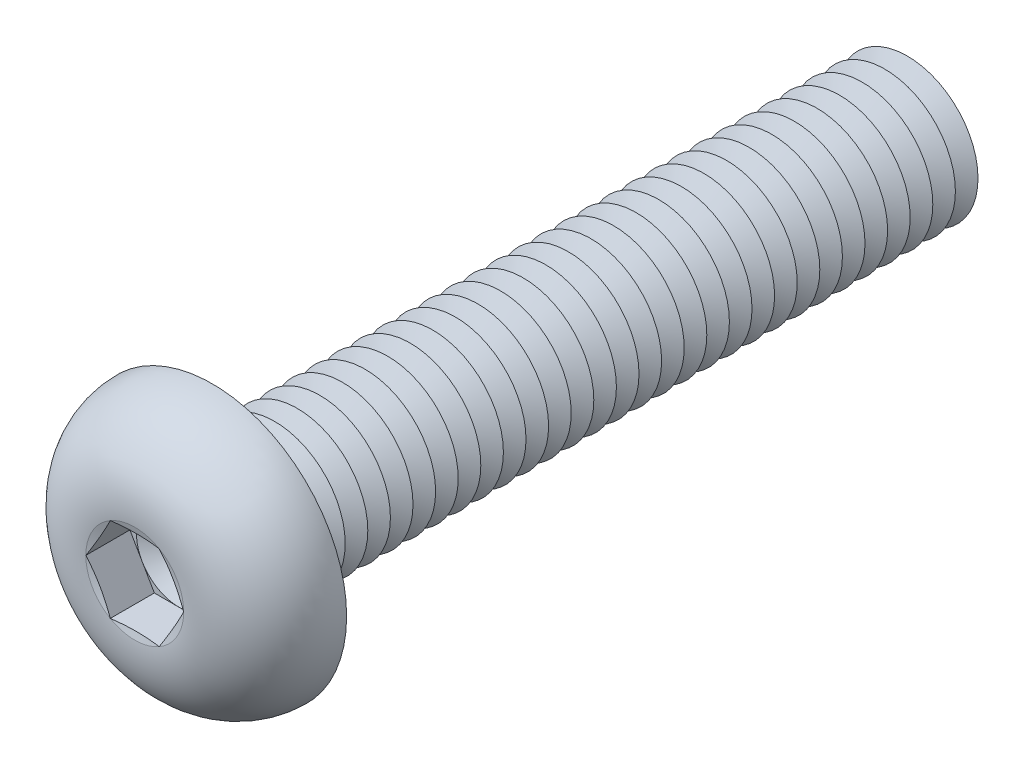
ISO-10303-21;
HEADER;
FILE_DESCRIPTION(('STEP AP214'),'2;1');
FILE_NAME('part.step','',(''),(''),'','','');
FILE_SCHEMA(('AUTOMOTIVE_DESIGN { 1 0 10303 214 1 1 1 1 }'));
ENDSEC;
DATA;
#1=APPLICATION_CONTEXT('core data for automotive mechanical design processes');
#2=APPLICATION_PROTOCOL_DEFINITION('international standard','automotive_design',2000,#1);
#3=PRODUCT_CONTEXT('',#1,'mechanical');
#4=PRODUCT('Part','Part','',(#3));
#5=PRODUCT_RELATED_PRODUCT_CATEGORY('part','',(#4));
#6=PRODUCT_DEFINITION_FORMATION('','',#4);
#7=PRODUCT_DEFINITION_CONTEXT('part definition',#1,'design');
#8=PRODUCT_DEFINITION('design','',#6,#7);
#9=PRODUCT_DEFINITION_SHAPE('','',#8);
#10=(LENGTH_UNIT() NAMED_UNIT(*) SI_UNIT(.MILLI.,.METRE.));
#11=(NAMED_UNIT(*) PLANE_ANGLE_UNIT() SI_UNIT($,.RADIAN.));
#12=(NAMED_UNIT(*) SI_UNIT($,.STERADIAN.) SOLID_ANGLE_UNIT());
#13=UNCERTAINTY_MEASURE_WITH_UNIT(LENGTH_MEASURE(1.E-05),#10,'distance_accuracy_value','');
#14=(GEOMETRIC_REPRESENTATION_CONTEXT(3) GLOBAL_UNCERTAINTY_ASSIGNED_CONTEXT((#13)) GLOBAL_UNIT_ASSIGNED_CONTEXT((#10,
#11,#12)) REPRESENTATION_CONTEXT('',''));
#15=CARTESIAN_POINT('',(0.,0.,0.));
#16=DIRECTION('',(0.,0.,1.));
#17=DIRECTION('',(1.,0.,0.));
#18=AXIS2_PLACEMENT_3D('',#15,#16,#17);
#19=CARTESIAN_POINT('',(0.,0.,1.19));
#20=DIRECTION('',(0.,0.,1.));
#21=DIRECTION('',(1.,0.,0.));
#22=AXIS2_PLACEMENT_3D('',#19,#20,#21);
#23=PLANE('',#22);
#24=CARTESIAN_POINT('',(0.,0.,1.19));
#25=DIRECTION('',(0.,0.,1.));
#26=DIRECTION('',(1.,0.,0.));
#27=AXIS2_PLACEMENT_3D('',#24,#25,#26);
#28=CIRCLE('',#27,1.49999930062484);
#29=CARTESIAN_POINT('',(1.2990375,0.749999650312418,1.19));
#30=VERTEX_POINT('',#29);
#31=CARTESIAN_POINT('',(0.,1.49999930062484,1.19));
#32=VERTEX_POINT('',#31);
#33=EDGE_CURVE('E118',#30,#32,#28,.T.);
#34=ORIENTED_EDGE('',*,*,#33,.F.);
#35=DIRECTION('',(-0.5,0.866025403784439,0.));
#36=VECTOR('',#35,1.);
#37=CARTESIAN_POINT('',(1.73205,0.,1.19));
#38=LINE('',#37,#36);
#39=CARTESIAN_POINT('',(0.866025,1.49999930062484,1.19));
#40=VERTEX_POINT('',#39);
#41=EDGE_CURVE('E125',#30,#40,#38,.T.);
#42=ORIENTED_EDGE('',*,*,#41,.T.);
#43=DIRECTION('',(-1.,0.,0.));
#44=VECTOR('',#43,1.);
#45=CARTESIAN_POINT('',(0.866025,1.49999930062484,1.19));
#46=LINE('',#45,#44);
#47=EDGE_CURVE('E136',#40,#32,#46,.T.);
#48=ORIENTED_EDGE('',*,*,#47,.T.);
#49=EDGE_LOOP('',(#34,#42,#48));
#50=FACE_BOUND('',#49,.T.);
#51=ADVANCED_FACE('F39',(#50),#23,.T.);
#52=CARTESIAN_POINT('',(0.,0.,1.19));
#53=DIRECTION('',(0.,0.,1.));
#54=DIRECTION('',(1.,0.,0.));
#55=AXIS2_PLACEMENT_3D('',#52,#53,#54);
#56=CIRCLE('',#55,1.49999930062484);
#57=CARTESIAN_POINT('',(-1.2990375,0.749999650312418,1.19));
#58=VERTEX_POINT('',#57);
#59=EDGE_CURVE('E11',#32,#58,#56,.T.);
#60=ORIENTED_EDGE('',*,*,#59,.F.);
#61=CARTESIAN_POINT('',(-0.866025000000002,1.49999930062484,1.19));
#62=VERTEX_POINT('',#61);
#63=EDGE_CURVE('E131',#32,#62,#46,.T.);
#64=ORIENTED_EDGE('',*,*,#63,.T.);
#65=DIRECTION('',(-0.5,-0.866025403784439,0.));
#66=VECTOR('',#65,1.);
#67=CARTESIAN_POINT('',(-0.866025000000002,1.49999930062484,1.19));
#68=LINE('',#67,#66);
#69=EDGE_CURVE('E134',#62,#58,#68,.T.);
#70=ORIENTED_EDGE('',*,*,#69,.T.);
#71=EDGE_LOOP('',(#60,#64,#70));
#72=FACE_BOUND('',#71,.T.);
#73=ADVANCED_FACE('F130',(#72),#23,.T.);
#74=CARTESIAN_POINT('',(-1.2990375,-0.749999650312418,1.19));
#75=VERTEX_POINT('',#74);
#76=EDGE_CURVE('E49',#58,#75,#56,.T.);
#77=ORIENTED_EDGE('',*,*,#76,.F.);
#78=CARTESIAN_POINT('',(-1.73205,0.,1.19));
#79=VERTEX_POINT('',#78);
#80=EDGE_CURVE('E143',#58,#79,#68,.T.);
#81=ORIENTED_EDGE('',*,*,#80,.T.);
#82=DIRECTION('',(0.5,-0.866025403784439,0.));
#83=VECTOR('',#82,1.);
#84=CARTESIAN_POINT('',(-1.73205,0.,1.19));
#85=LINE('',#84,#83);
#86=EDGE_CURVE('E152',#79,#75,#85,.T.);
#87=ORIENTED_EDGE('',*,*,#86,.T.);
#88=EDGE_LOOP('',(#77,#81,#87));
#89=FACE_BOUND('',#88,.T.);
#90=ADVANCED_FACE('F521',(#89),#23,.T.);
#91=CARTESIAN_POINT('',(0.,-1.49999930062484,1.19));
#92=VERTEX_POINT('',#91);
#93=EDGE_CURVE('E505',#75,#92,#56,.T.);
#94=ORIENTED_EDGE('',*,*,#93,.F.);
#95=CARTESIAN_POINT('',(-0.866025,-1.49999930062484,1.19));
#96=VERTEX_POINT('',#95);
#97=EDGE_CURVE('E151',#75,#96,#85,.T.);
#98=ORIENTED_EDGE('',*,*,#97,.T.);
#99=DIRECTION('',(1.,0.,0.));
#100=VECTOR('',#99,1.);
#101=CARTESIAN_POINT('',(-0.866025,-1.49999930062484,1.19));
#102=LINE('',#101,#100);
#103=EDGE_CURVE('E157',#96,#92,#102,.T.);
#104=ORIENTED_EDGE('',*,*,#103,.T.);
#105=EDGE_LOOP('',(#94,#98,#104));
#106=FACE_BOUND('',#105,.T.);
#107=ADVANCED_FACE('F514',(#106),#23,.T.);
#108=CARTESIAN_POINT('',(1.2990375,-0.749999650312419,1.19));
#109=VERTEX_POINT('',#108);
#110=EDGE_CURVE('E56',#92,#109,#56,.T.);
#111=ORIENTED_EDGE('',*,*,#110,.F.);
#112=CARTESIAN_POINT('',(0.866025,-1.49999930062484,1.19));
#113=VERTEX_POINT('',#112);
#114=EDGE_CURVE('E156',#92,#113,#102,.T.);
#115=ORIENTED_EDGE('',*,*,#114,.T.);
#116=DIRECTION('',(0.5,0.866025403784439,0.));
#117=VECTOR('',#116,1.);
#118=CARTESIAN_POINT('',(0.866025,-1.49999930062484,1.19));
#119=LINE('',#118,#117);
#120=EDGE_CURVE('E162',#113,#109,#119,.T.);
#121=ORIENTED_EDGE('',*,*,#120,.T.);
#122=EDGE_LOOP('',(#111,#115,#121));
#123=FACE_BOUND('',#122,.T.);
#124=ADVANCED_FACE('F594',(#123),#23,.T.);
#125=CARTESIAN_POINT('',(0.,0.,2.75));
#126=DIRECTION('',(0.,0.,1.));
#127=DIRECTION('',(1.,0.,0.));
#128=AXIS2_PLACEMENT_3D('',#125,#126,#127);
#129=CONICAL_SURFACE('',#128,1.73205,1.30899693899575);
#130=CARTESIAN_POINT('',(1.73216547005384,-0.000200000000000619,2.75003094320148));
#131=CARTESIAN_POINT('',(1.69619207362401,0.0621077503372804,2.74038633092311));
#132=CARTESIAN_POINT('',(1.66015343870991,0.124528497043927,2.73163050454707));
#133=CARTESIAN_POINT('',(1.58794885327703,0.249590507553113,2.71624720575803));
#134=CARTESIAN_POINT('',(1.5517828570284,0.312231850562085,2.70962059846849));
#135=CARTESIAN_POINT('',(1.47954289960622,0.437355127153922,2.69888271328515));
#136=CARTESIAN_POINT('',(1.4434694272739,0.499836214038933,2.69475862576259));
#137=CARTESIAN_POINT('',(1.37127646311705,0.624878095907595,2.68922863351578));
#138=CARTESIAN_POINT('',(1.33515698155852,0.687438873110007,2.68782220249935));
#139=CARTESIAN_POINT('',(1.26291801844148,0.812560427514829,2.68782220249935));
#140=CARTESIAN_POINT('',(1.22679853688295,0.87512120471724,2.68922863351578));
#141=CARTESIAN_POINT('',(1.1546055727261,1.0001630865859,2.69475862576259));
#142=CARTESIAN_POINT('',(1.11853210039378,1.06264417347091,2.69888271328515));
#143=CARTESIAN_POINT('',(1.0462921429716,1.18776745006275,2.70962059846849));
#144=CARTESIAN_POINT('',(1.01012614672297,1.25040879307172,2.71624720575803));
#145=CARTESIAN_POINT('',(0.937921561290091,1.37547080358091,2.73163050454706));
#146=CARTESIAN_POINT('',(0.901882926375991,1.43789155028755,2.74038633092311));
#147=CARTESIAN_POINT('',(0.865909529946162,1.50019930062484,2.75003094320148));
#148=B_SPLINE_CURVE_WITH_KNOTS('',3,(#130,#131,#132,#133,#134,#135,#136,#137,#138,#139,#140,
#141,#142,#143,#144,#145,#146,#147),.UNSPECIFIED.,.F.,.F.,(4,2,2,2,2,2,2,2,4),(0.,
0.217782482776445,0.435653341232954,0.652399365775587,0.869103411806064,1.08580745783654,
1.30255348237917,1.52042434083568,1.73820682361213),.UNSPECIFIED.);
#149=CARTESIAN_POINT('',(1.73205,0.,2.75));
#150=VERTEX_POINT('',#149);
#151=CARTESIAN_POINT('',(0.866025,1.49999930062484,2.75));
#152=VERTEX_POINT('',#151);
#153=EDGE_CURVE('E222',#150,#152,#148,.T.);
#154=ORIENTED_EDGE('',*,*,#153,.F.);
#155=CARTESIAN_POINT('',(0.,0.,2.75));
#156=DIRECTION('',(0.,0.,-1.));
#157=DIRECTION('',(-1.,0.,0.));
#158=AXIS2_PLACEMENT_3D('',#155,#156,#157);
#159=CIRCLE('',#158,1.73205);
#160=EDGE_CURVE('E551',#152,#150,#159,.T.);
#161=ORIENTED_EDGE('',*,*,#160,.F.);
#162=EDGE_LOOP('',(#154,#161));
#163=FACE_BOUND('',#162,.T.);
#164=ADVANCED_FACE('F598',(#163),#129,.F.);
#165=CARTESIAN_POINT('',(0.865909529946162,-1.50019930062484,2.75003094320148));
#166=CARTESIAN_POINT('',(0.901882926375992,-1.43789155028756,2.74038633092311));
#167=CARTESIAN_POINT('',(0.937921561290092,-1.37547080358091,2.73163050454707));
#168=CARTESIAN_POINT('',(1.01012614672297,-1.25040879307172,2.71624720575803));
#169=CARTESIAN_POINT('',(1.0462921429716,-1.18776745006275,2.70962059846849));
#170=CARTESIAN_POINT('',(1.11853210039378,-1.06264417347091,2.69888271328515));
#171=CARTESIAN_POINT('',(1.1546055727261,-1.0001630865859,2.69475862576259));
#172=CARTESIAN_POINT('',(1.22679853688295,-0.875121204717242,2.68922863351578));
#173=CARTESIAN_POINT('',(1.26291801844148,-0.81256042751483,2.68782220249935));
#174=CARTESIAN_POINT('',(1.33515698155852,-0.687438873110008,2.68782220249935));
#175=CARTESIAN_POINT('',(1.37127646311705,-0.624878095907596,2.68922863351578));
#176=CARTESIAN_POINT('',(1.4434694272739,-0.499836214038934,2.69475862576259));
#177=CARTESIAN_POINT('',(1.47954289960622,-0.437355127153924,2.69888271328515));
#178=CARTESIAN_POINT('',(1.5517828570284,-0.312231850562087,2.70962059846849));
#179=CARTESIAN_POINT('',(1.58794885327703,-0.249590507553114,2.71624720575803));
#180=CARTESIAN_POINT('',(1.66015343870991,-0.124528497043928,2.73163050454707));
#181=CARTESIAN_POINT('',(1.69619207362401,-0.0621077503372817,2.74038633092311));
#182=CARTESIAN_POINT('',(1.73216547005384,0.000199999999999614,2.75003094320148));
#183=B_SPLINE_CURVE_WITH_KNOTS('',3,(#165,#166,#167,#168,#169,#170,#171,#172,#173,#174,#175,
#176,#177,#178,#179,#180,#181,#182),.UNSPECIFIED.,.F.,.F.,(4,2,2,2,2,2,2,2,4),(0.,
0.217782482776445,0.435653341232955,0.652399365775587,0.869103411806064,1.08580745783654,
1.30255348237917,1.52042434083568,1.73820682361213),.UNSPECIFIED.);
#184=CARTESIAN_POINT('',(0.866025,-1.49999930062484,2.75));
#185=VERTEX_POINT('',#184);
#186=EDGE_CURVE('E231',#185,#150,#183,.T.);
#187=ORIENTED_EDGE('',*,*,#186,.F.);
#188=EDGE_CURVE('E553',#150,#185,#159,.T.);
#189=ORIENTED_EDGE('',*,*,#188,.F.);
#190=EDGE_LOOP('',(#187,#189));
#191=FACE_BOUND('',#190,.T.);
#192=ADVANCED_FACE('F560',(#191),#129,.F.);
#193=CARTESIAN_POINT('',(-2.61375031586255,-1.49999930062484,3.09338600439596));
#194=CARTESIAN_POINT('',(-2.48719895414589,-1.49999930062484,3.06401688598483));
#195=CARTESIAN_POINT('',(-2.36054180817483,-1.49999930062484,3.03507426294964));
#196=CARTESIAN_POINT('',(-2.10688190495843,-1.49999930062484,2.97862489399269));
#197=CARTESIAN_POINT('',(-1.97987908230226,-1.49999930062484,2.95111844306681));
#198=CARTESIAN_POINT('',(-1.72425281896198,-1.49999930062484,2.89788845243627));
#199=CARTESIAN_POINT('',(-1.59562534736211,-1.49999930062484,2.87218404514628));
#200=CARTESIAN_POINT('',(-1.33776732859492,-1.49999930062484,2.82387586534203));
#201=CARTESIAN_POINT('',(-1.20853672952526,-1.49999930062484,2.80127236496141));
#202=CARTESIAN_POINT('',(-0.952831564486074,-1.49999930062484,2.76126658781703));
#203=CARTESIAN_POINT('',(-0.826376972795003,-1.49999930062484,2.74374018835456));
#204=CARTESIAN_POINT('',(-0.572755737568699,-1.49999930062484,2.71502809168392));
#205=CARTESIAN_POINT('',(-0.445589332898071,-1.49999930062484,2.70384038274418));
#206=CARTESIAN_POINT('',(-0.191333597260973,-1.49999930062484,2.68972083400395));
#207=CARTESIAN_POINT('',(-0.0642464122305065,-1.49999930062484,2.68675270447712));
#208=CARTESIAN_POINT('',(0.189835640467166,-1.49999930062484,2.68959577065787));
#209=CARTESIAN_POINT('',(0.31683049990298,-1.49999930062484,2.69540767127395));
#210=CARTESIAN_POINT('',(0.53418249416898,-1.49999930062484,2.71190493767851));
#211=CARTESIAN_POINT('',(0.624691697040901,-1.49999930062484,2.72073513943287));
#212=CARTESIAN_POINT('',(0.805336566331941,-1.49999930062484,2.74156379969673));
#213=CARTESIAN_POINT('',(0.895472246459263,-1.49999930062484,2.75356214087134));
#214=CARTESIAN_POINT('',(1.0756572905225,-1.49999930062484,2.78006977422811));
#215=CARTESIAN_POINT('',(1.16570548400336,-1.49999930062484,2.7945868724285));
#216=CARTESIAN_POINT('',(1.3454787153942,-1.49999930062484,2.82550612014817));
#217=CARTESIAN_POINT('',(1.43520373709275,-1.49999930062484,2.8419083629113));
#218=CARTESIAN_POINT('',(1.61622412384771,-1.49999930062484,2.87648604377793));
#219=CARTESIAN_POINT('',(1.70751379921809,-1.49999930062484,2.89469103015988));
#220=CARTESIAN_POINT('',(1.88986344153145,-1.49999930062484,2.93221618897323));
#221=CARTESIAN_POINT('',(1.98092340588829,-1.49999930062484,2.95153637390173));
#222=CARTESIAN_POINT('',(2.16236354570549,-1.49999930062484,2.99091506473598));
#223=CARTESIAN_POINT('',(2.25274472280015,-1.49999930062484,3.01096897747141));
#224=CARTESIAN_POINT('',(2.43335289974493,-1.49999930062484,3.05173139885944));
#225=CARTESIAN_POINT('',(2.52357990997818,-1.49999930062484,3.07243986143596));
#226=CARTESIAN_POINT('',(2.61375031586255,-1.49999930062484,3.09338600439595));
#227=B_SPLINE_CURVE_WITH_KNOTS('',3,(#193,#194,#195,#196,#197,#198,#199,#200,#201,#202,#203,
#204,#205,#206,#207,#208,#209,#210,#211,#212,#213,#214,#215,#216,#217,#218,#219,#220,#221,#222,
#223,#224,#225,#226),.UNSPECIFIED.,.F.,.F.,(4,2,2,2,2,2,2,2,2,2,2,2,2,2,2,2,4),(0.,
0.389753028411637,0.779585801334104,1.17307326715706,1.5665952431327,1.94947555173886,
2.33223427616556,2.71330039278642,3.09439710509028,3.36715350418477,3.63989980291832,
3.91350699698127,4.18712773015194,4.4663802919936,4.74563598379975,5.02337106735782,
5.3010866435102),.UNSPECIFIED.);
#228=CARTESIAN_POINT('',(-0.866025,-1.49999930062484,2.75));
#229=VERTEX_POINT('',#228);
#230=EDGE_CURVE('E533',#229,#185,#227,.T.);
#231=ORIENTED_EDGE('',*,*,#230,.F.);
#232=EDGE_CURVE('E541',#185,#229,#159,.T.);
#233=ORIENTED_EDGE('',*,*,#232,.F.);
#234=EDGE_LOOP('',(#231,#233));
#235=FACE_BOUND('',#234,.T.);
#236=ADVANCED_FACE('F566',(#235),#129,.F.);
#237=CARTESIAN_POINT('',(-1.73216547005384,0.000200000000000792,2.75003094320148));
#238=CARTESIAN_POINT('',(-1.69619207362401,-0.0621077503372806,2.74038633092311));
#239=CARTESIAN_POINT('',(-1.66015343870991,-0.124528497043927,2.73163050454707));
#240=CARTESIAN_POINT('',(-1.58794885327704,-0.249590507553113,2.71624720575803));
#241=CARTESIAN_POINT('',(-1.55178285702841,-0.312231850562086,2.70962059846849));
#242=CARTESIAN_POINT('',(-1.47954289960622,-0.437355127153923,2.69888271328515));
#243=CARTESIAN_POINT('',(-1.4434694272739,-0.499836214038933,2.69475862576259));
#244=CARTESIAN_POINT('',(-1.37127646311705,-0.624878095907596,2.68922863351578));
#245=CARTESIAN_POINT('',(-1.33515698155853,-0.687438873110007,2.68782220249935));
#246=CARTESIAN_POINT('',(-1.26291801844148,-0.81256042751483,2.68782220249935));
#247=CARTESIAN_POINT('',(-1.22679853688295,-0.875121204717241,2.68922863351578));
#248=CARTESIAN_POINT('',(-1.1546055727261,-1.0001630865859,2.69475862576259));
#249=CARTESIAN_POINT('',(-1.11853210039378,-1.06264417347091,2.69888271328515));
#250=CARTESIAN_POINT('',(-1.0462921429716,-1.18776745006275,2.70962059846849));
#251=CARTESIAN_POINT('',(-1.01012614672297,-1.25040879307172,2.71624720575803));
#252=CARTESIAN_POINT('',(-0.937921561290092,-1.37547080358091,2.73163050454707));
#253=CARTESIAN_POINT('',(-0.901882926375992,-1.43789155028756,2.74038633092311));
#254=CARTESIAN_POINT('',(-0.865909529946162,-1.50019930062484,2.75003094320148));
#255=B_SPLINE_CURVE_WITH_KNOTS('',3,(#237,#238,#239,#240,#241,#242,#243,#244,#245,#246,#247,
#248,#249,#250,#251,#252,#253,#254),.UNSPECIFIED.,.F.,.F.,(4,2,2,2,2,2,2,2,4),(0.,
0.217782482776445,0.435653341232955,0.652399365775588,0.869103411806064,1.08580745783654,
1.30255348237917,1.52042434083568,1.73820682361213),.UNSPECIFIED.);
#256=CARTESIAN_POINT('',(-1.73205,0.,2.75));
#257=VERTEX_POINT('',#256);
#258=EDGE_CURVE('E526',#257,#229,#255,.T.);
#259=ORIENTED_EDGE('',*,*,#258,.F.);
#260=EDGE_CURVE('E484',#229,#257,#159,.T.);
#261=ORIENTED_EDGE('',*,*,#260,.F.);
#262=EDGE_LOOP('',(#259,#261));
#263=FACE_BOUND('',#262,.T.);
#264=ADVANCED_FACE('F530',(#263),#129,.F.);
#265=CARTESIAN_POINT('',(-0.865909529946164,1.50019930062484,2.75003094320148));
#266=CARTESIAN_POINT('',(-0.901882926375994,1.43789155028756,2.74038633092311));
#267=CARTESIAN_POINT('',(-0.937921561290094,1.37547080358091,2.73163050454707));
#268=CARTESIAN_POINT('',(-1.01012614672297,1.25040879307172,2.71624720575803));
#269=CARTESIAN_POINT('',(-1.0462921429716,1.18776745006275,2.70962059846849));
#270=CARTESIAN_POINT('',(-1.11853210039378,1.06264417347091,2.69888271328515));
#271=CARTESIAN_POINT('',(-1.1546055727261,1.0001630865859,2.69475862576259));
#272=CARTESIAN_POINT('',(-1.22679853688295,0.875121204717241,2.68922863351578));
#273=CARTESIAN_POINT('',(-1.26291801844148,0.81256042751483,2.68782220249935));
#274=CARTESIAN_POINT('',(-1.33515698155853,0.687438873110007,2.68782220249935));
#275=CARTESIAN_POINT('',(-1.37127646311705,0.624878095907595,2.68922863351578));
#276=CARTESIAN_POINT('',(-1.4434694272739,0.499836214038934,2.69475862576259));
#277=CARTESIAN_POINT('',(-1.47954289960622,0.437355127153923,2.69888271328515));
#278=CARTESIAN_POINT('',(-1.55178285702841,0.312231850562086,2.70962059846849));
#279=CARTESIAN_POINT('',(-1.58794885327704,0.249590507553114,2.71624720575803));
#280=CARTESIAN_POINT('',(-1.66015343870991,0.124528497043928,2.73163050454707));
#281=CARTESIAN_POINT('',(-1.69619207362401,0.0621077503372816,2.74038633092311));
#282=CARTESIAN_POINT('',(-1.73216547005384,-0.000199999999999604,2.75003094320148));
#283=B_SPLINE_CURVE_WITH_KNOTS('',3,(#265,#266,#267,#268,#269,#270,#271,#272,#273,#274,#275,
#276,#277,#278,#279,#280,#281,#282),.UNSPECIFIED.,.F.,.F.,(4,2,2,2,2,2,2,2,4),(0.,
0.217782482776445,0.435653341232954,0.652399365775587,0.869103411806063,1.08580745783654,
1.30255348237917,1.52042434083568,1.73820682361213),.UNSPECIFIED.);
#284=CARTESIAN_POINT('',(-0.866025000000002,1.49999930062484,2.75));
#285=VERTEX_POINT('',#284);
#286=EDGE_CURVE('E195',#285,#257,#283,.T.);
#287=ORIENTED_EDGE('',*,*,#286,.F.);
#288=EDGE_CURVE('E485',#257,#285,#159,.T.);
#289=ORIENTED_EDGE('',*,*,#288,.F.);
#290=EDGE_LOOP('',(#287,#289));
#291=FACE_BOUND('',#290,.T.);
#292=ADVANCED_FACE('F544',(#291),#129,.F.);
#293=CARTESIAN_POINT('',(0.,0.,-22.2));
#294=DIRECTION('',(0.,0.,1.));
#295=DIRECTION('',(1.,0.,0.));
#296=AXIS2_PLACEMENT_3D('',#293,#294,#295);
#297=CONICAL_SURFACE('',#296,2.50000000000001,1.0471975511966);
#298=CARTESIAN_POINT('',(0.,0.,-22.6));
#299=DIRECTION('',(0.,0.,1.));
#300=DIRECTION('',(1.,0.,0.));
#301=AXIS2_PLACEMENT_3D('',#298,#299,#300);
#302=CIRCLE('',#301,1.80717967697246);
#303=CARTESIAN_POINT('',(1.80717967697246,0.,-22.6));
#304=VERTEX_POINT('',#303);
#305=EDGE_CURVE('E456',#304,#304,#302,.T.);
#306=ORIENTED_EDGE('',*,*,#305,.T.);
#307=EDGE_LOOP('',(#306));
#308=FACE_BOUND('',#307,.T.);
#309=CARTESIAN_POINT('',(0.,0.,-22.2));
#310=DIRECTION('',(0.,0.,1.));
#311=DIRECTION('',(1.,0.,0.));
#312=AXIS2_PLACEMENT_3D('',#309,#310,#311);
#313=CIRCLE('',#312,2.50000000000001);
#314=CARTESIAN_POINT('',(2.50000000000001,0.,-22.2));
#315=VERTEX_POINT('',#314);
#316=EDGE_CURVE('E452',#315,#315,#313,.T.);
#317=ORIENTED_EDGE('',*,*,#316,.F.);
#318=EDGE_LOOP('',(#317));
#319=FACE_BOUND('',#318,.T.);
#320=ADVANCED_FACE('F731',(#308,#319),#297,.T.);
#321=CARTESIAN_POINT('',(0.,0.,-22.6));
#322=DIRECTION('',(0.,0.,-1.));
#323=DIRECTION('',(-1.,0.,0.));
#324=AXIS2_PLACEMENT_3D('',#321,#322,#323);
#325=CONICAL_SURFACE('',#324,1.80717967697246,1.0471975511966);
#326=CARTESIAN_POINT('',(0.,0.,-23.));
#327=DIRECTION('',(0.,0.,1.));
#328=DIRECTION('',(1.,0.,0.));
#329=AXIS2_PLACEMENT_3D('',#326,#327,#328);
#330=CIRCLE('',#329,2.50000000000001);
#331=CARTESIAN_POINT('',(2.50000000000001,0.,-23.));
#332=VERTEX_POINT('',#331);
#333=EDGE_CURVE('E460',#332,#332,#330,.T.);
#334=ORIENTED_EDGE('',*,*,#333,.T.);
#335=EDGE_LOOP('',(#334));
#336=FACE_BOUND('',#335,.T.);
#337=ORIENTED_EDGE('',*,*,#305,.F.);
#338=EDGE_LOOP('',(#337));
#339=FACE_BOUND('',#338,.T.);
#340=ADVANCED_FACE('F1314',(#336,#339),#325,.T.);
#341=CARTESIAN_POINT('',(0.,2.50000000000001,-25.));
#342=DIRECTION('',(0.,0.,-1.));
#343=DIRECTION('',(-1.,0.,0.));
#344=AXIS2_PLACEMENT_3D('',#341,#342,#343);
#345=PLANE('',#344);
#346=CARTESIAN_POINT('',(0.,0.,-25.));
#347=DIRECTION('',(0.,0.,1.));
#348=DIRECTION('',(1.,0.,0.));
#349=AXIS2_PLACEMENT_3D('',#346,#347,#348);
#350=CIRCLE('',#349,1.80717967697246);
#351=CARTESIAN_POINT('',(1.80717967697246,0.,-25.));
#352=VERTEX_POINT('',#351);
#353=EDGE_CURVE('E480',#352,#352,#350,.T.);
#354=ORIENTED_EDGE('',*,*,#353,.F.);
#355=EDGE_LOOP('',(#354));
#356=FACE_BOUND('',#355,.T.);
#357=ADVANCED_FACE('F1319',(#356),#345,.T.);
#358=CARTESIAN_POINT('',(0.,0.,-24.6));
#359=DIRECTION('',(0.,0.,1.));
#360=DIRECTION('',(1.,0.,0.));
#361=AXIS2_PLACEMENT_3D('',#358,#359,#360);
#362=CONICAL_SURFACE('',#361,2.50000000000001,1.0471975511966);
#363=ORIENTED_EDGE('',*,*,#353,.T.);
#364=EDGE_LOOP('',(#363));
#365=FACE_BOUND('',#364,.T.);
#366=CARTESIAN_POINT('',(0.,0.,-24.6));
#367=DIRECTION('',(0.,0.,1.));
#368=DIRECTION('',(1.,0.,0.));
#369=AXIS2_PLACEMENT_3D('',#366,#367,#368);
#370=CIRCLE('',#369,2.50000000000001);
#371=CARTESIAN_POINT('',(2.50000000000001,0.,-24.6));
#372=VERTEX_POINT('',#371);
#373=EDGE_CURVE('E476',#372,#372,#370,.T.);
#374=ORIENTED_EDGE('',*,*,#373,.F.);
#375=EDGE_LOOP('',(#374));
#376=FACE_BOUND('',#375,.T.);
#377=ADVANCED_FACE('F1308',(#365,#376),#362,.T.);
#378=CARTESIAN_POINT('',(0.,0.,-24.2));
#379=DIRECTION('',(0.,0.,-1.));
#380=DIRECTION('',(-1.,0.,0.));
#381=AXIS2_PLACEMENT_3D('',#378,#379,#380);
#382=CONICAL_SURFACE('',#381,1.80717967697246,1.0471975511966);
#383=ORIENTED_EDGE('',*,*,#373,.T.);
#384=EDGE_LOOP('',(#383));
#385=FACE_BOUND('',#384,.T.);
#386=CARTESIAN_POINT('',(0.,0.,-24.2));
#387=DIRECTION('',(0.,0.,1.));
#388=DIRECTION('',(1.,0.,0.));
#389=AXIS2_PLACEMENT_3D('',#386,#387,#388);
#390=CIRCLE('',#389,1.80717967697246);
#391=CARTESIAN_POINT('',(1.80717967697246,0.,-24.2));
#392=VERTEX_POINT('',#391);
#393=EDGE_CURVE('E472',#392,#392,#390,.T.);
#394=ORIENTED_EDGE('',*,*,#393,.F.);
#395=EDGE_LOOP('',(#394));
#396=FACE_BOUND('',#395,.T.);
#397=ADVANCED_FACE('F1298',(#385,#396),#382,.T.);
#398=CARTESIAN_POINT('',(0.,0.,-23.8));
#399=DIRECTION('',(0.,0.,1.));
#400=DIRECTION('',(1.,0.,0.));
#401=AXIS2_PLACEMENT_3D('',#398,#399,#400);
#402=CONICAL_SURFACE('',#401,2.50000000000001,1.0471975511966);
#403=ORIENTED_EDGE('',*,*,#393,.T.);
#404=EDGE_LOOP('',(#403));
#405=FACE_BOUND('',#404,.T.);
#406=CARTESIAN_POINT('',(0.,0.,-23.8));
#407=DIRECTION('',(0.,0.,1.));
#408=DIRECTION('',(1.,0.,0.));
#409=AXIS2_PLACEMENT_3D('',#406,#407,#408);
#410=CIRCLE('',#409,2.50000000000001);
#411=CARTESIAN_POINT('',(2.50000000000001,0.,-23.8));
#412=VERTEX_POINT('',#411);
#413=EDGE_CURVE('E468',#412,#412,#410,.T.);
#414=ORIENTED_EDGE('',*,*,#413,.F.);
#415=EDGE_LOOP('',(#414));
#416=FACE_BOUND('',#415,.T.);
#417=ADVANCED_FACE('F1288',(#405,#416),#402,.T.);
#418=CARTESIAN_POINT('',(0.,0.,-23.4));
#419=DIRECTION('',(0.,0.,-1.));
#420=DIRECTION('',(-1.,0.,0.));
#421=AXIS2_PLACEMENT_3D('',#418,#419,#420);
#422=CONICAL_SURFACE('',#421,1.80717967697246,1.0471975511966);
#423=ORIENTED_EDGE('',*,*,#413,.T.);
#424=EDGE_LOOP('',(#423));
#425=FACE_BOUND('',#424,.T.);
#426=CARTESIAN_POINT('',(0.,0.,-23.4));
#427=DIRECTION('',(0.,0.,1.));
#428=DIRECTION('',(1.,0.,0.));
#429=AXIS2_PLACEMENT_3D('',#426,#427,#428);
#430=CIRCLE('',#429,1.80717967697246);
#431=CARTESIAN_POINT('',(1.80717967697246,0.,-23.4));
#432=VERTEX_POINT('',#431);
#433=EDGE_CURVE('E464',#432,#432,#430,.T.);
#434=ORIENTED_EDGE('',*,*,#433,.F.);
#435=EDGE_LOOP('',(#434));
#436=FACE_BOUND('',#435,.T.);
#437=ADVANCED_FACE('F1278',(#425,#436),#422,.T.);
#438=CARTESIAN_POINT('',(0.,0.,-23.));
#439=DIRECTION('',(0.,0.,1.));
#440=DIRECTION('',(1.,0.,0.));
#441=AXIS2_PLACEMENT_3D('',#438,#439,#440);
#442=CONICAL_SURFACE('',#441,2.50000000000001,1.0471975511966);
#443=ORIENTED_EDGE('',*,*,#433,.T.);
#444=EDGE_LOOP('',(#443));
#445=FACE_BOUND('',#444,.T.);
#446=ORIENTED_EDGE('',*,*,#333,.F.);
#447=EDGE_LOOP('',(#446));
#448=FACE_BOUND('',#447,.T.);
#449=ADVANCED_FACE('F1268',(#445,#448),#442,.T.);
#450=CARTESIAN_POINT('',(0.,0.,-21.4));
#451=DIRECTION('',(0.,0.,1.));
#452=DIRECTION('',(1.,0.,0.));
#453=AXIS2_PLACEMENT_3D('',#450,#451,#452);
#454=CONICAL_SURFACE('',#453,2.50000000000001,1.0471975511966);
#455=CARTESIAN_POINT('',(0.,0.,-21.8));
#456=DIRECTION('',(0.,0.,1.));
#457=DIRECTION('',(1.,0.,0.));
#458=AXIS2_PLACEMENT_3D('',#455,#456,#457);
#459=CIRCLE('',#458,1.80717967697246);
#460=CARTESIAN_POINT('',(1.80717967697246,0.,-21.8));
#461=VERTEX_POINT('',#460);
#462=EDGE_CURVE('E448',#461,#461,#459,.T.);
#463=ORIENTED_EDGE('',*,*,#462,.T.);
#464=EDGE_LOOP('',(#463));
#465=FACE_BOUND('',#464,.T.);
#466=CARTESIAN_POINT('',(0.,0.,-21.4));
#467=DIRECTION('',(0.,0.,1.));
#468=DIRECTION('',(1.,0.,0.));
#469=AXIS2_PLACEMENT_3D('',#466,#467,#468);
#470=CIRCLE('',#469,2.50000000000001);
#471=CARTESIAN_POINT('',(2.50000000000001,0.,-21.4));
#472=VERTEX_POINT('',#471);
#473=EDGE_CURVE('E444',#472,#472,#470,.T.);
#474=ORIENTED_EDGE('',*,*,#473,.F.);
#475=EDGE_LOOP('',(#474));
#476=FACE_BOUND('',#475,.T.);
#477=ADVANCED_FACE('F1258',(#465,#476),#454,.T.);
#478=CARTESIAN_POINT('',(0.,0.,-21.8));
#479=DIRECTION('',(0.,0.,-1.));
#480=DIRECTION('',(-1.,0.,0.));
#481=AXIS2_PLACEMENT_3D('',#478,#479,#480);
#482=CONICAL_SURFACE('',#481,1.80717967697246,1.0471975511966);
#483=ORIENTED_EDGE('',*,*,#316,.T.);
#484=EDGE_LOOP('',(#483));
#485=FACE_BOUND('',#484,.T.);
#486=ORIENTED_EDGE('',*,*,#462,.F.);
#487=EDGE_LOOP('',(#486));
#488=FACE_BOUND('',#487,.T.);
#489=ADVANCED_FACE('F1248',(#485,#488),#482,.T.);
#490=CARTESIAN_POINT('',(0.,0.,-20.6));
#491=DIRECTION('',(0.,0.,1.));
#492=DIRECTION('',(1.,0.,0.));
#493=AXIS2_PLACEMENT_3D('',#490,#491,#492);
#494=CONICAL_SURFACE('',#493,2.50000000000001,1.0471975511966);
#495=CARTESIAN_POINT('',(0.,0.,-21.));
#496=DIRECTION('',(0.,0.,1.));
#497=DIRECTION('',(1.,0.,0.));
#498=AXIS2_PLACEMENT_3D('',#495,#496,#497);
#499=CIRCLE('',#498,1.80717967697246);
#500=CARTESIAN_POINT('',(1.80717967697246,0.,-21.));
#501=VERTEX_POINT('',#500);
#502=EDGE_CURVE('E440',#501,#501,#499,.T.);
#503=ORIENTED_EDGE('',*,*,#502,.T.);
#504=EDGE_LOOP('',(#503));
#505=FACE_BOUND('',#504,.T.);
#506=CARTESIAN_POINT('',(0.,0.,-20.6));
#507=DIRECTION('',(0.,0.,1.));
#508=DIRECTION('',(1.,0.,0.));
#509=AXIS2_PLACEMENT_3D('',#506,#507,#508);
#510=CIRCLE('',#509,2.50000000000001);
#511=CARTESIAN_POINT('',(2.50000000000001,0.,-20.6));
#512=VERTEX_POINT('',#511);
#513=EDGE_CURVE('E437',#512,#512,#510,.T.);
#514=ORIENTED_EDGE('',*,*,#513,.F.);
#515=EDGE_LOOP('',(#514));
#516=FACE_BOUND('',#515,.T.);
#517=ADVANCED_FACE('F1238',(#505,#516),#494,.T.);
#518=CARTESIAN_POINT('',(0.,0.,-21.));
#519=DIRECTION('',(0.,0.,-1.));
#520=DIRECTION('',(-1.,0.,0.));
#521=AXIS2_PLACEMENT_3D('',#518,#519,#520);
#522=CONICAL_SURFACE('',#521,1.80717967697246,1.0471975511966);
#523=ORIENTED_EDGE('',*,*,#473,.T.);
#524=EDGE_LOOP('',(#523));
#525=FACE_BOUND('',#524,.T.);
#526=ORIENTED_EDGE('',*,*,#502,.F.);
#527=EDGE_LOOP('',(#526));
#528=FACE_BOUND('',#527,.T.);
#529=ADVANCED_FACE('F1228',(#525,#528),#522,.T.);
#530=CARTESIAN_POINT('',(0.,0.,-19.8));
#531=DIRECTION('',(0.,0.,1.));
#532=DIRECTION('',(1.,0.,0.));
#533=AXIS2_PLACEMENT_3D('',#530,#531,#532);
#534=CONICAL_SURFACE('',#533,2.50000000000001,1.0471975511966);
#535=CARTESIAN_POINT('',(0.,0.,-20.2));
#536=DIRECTION('',(0.,0.,1.));
#537=DIRECTION('',(1.,0.,0.));
#538=AXIS2_PLACEMENT_3D('',#535,#536,#537);
#539=CIRCLE('',#538,1.80717967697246);
#540=CARTESIAN_POINT('',(1.80717967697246,0.,-20.2));
#541=VERTEX_POINT('',#540);
#542=EDGE_CURVE('E433',#541,#541,#539,.T.);
#543=ORIENTED_EDGE('',*,*,#542,.T.);
#544=EDGE_LOOP('',(#543));
#545=FACE_BOUND('',#544,.T.);
#546=CARTESIAN_POINT('',(0.,0.,-19.8));
#547=DIRECTION('',(0.,0.,1.));
#548=DIRECTION('',(1.,0.,0.));
#549=AXIS2_PLACEMENT_3D('',#546,#547,#548);
#550=CIRCLE('',#549,2.50000000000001);
#551=CARTESIAN_POINT('',(2.50000000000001,0.,-19.8));
#552=VERTEX_POINT('',#551);
#553=EDGE_CURVE('E429',#552,#552,#550,.T.);
#554=ORIENTED_EDGE('',*,*,#553,.F.);
#555=EDGE_LOOP('',(#554));
#556=FACE_BOUND('',#555,.T.);
#557=ADVANCED_FACE('F1218',(#545,#556),#534,.T.);
#558=CARTESIAN_POINT('',(0.,0.,-20.2));
#559=DIRECTION('',(0.,0.,-1.));
#560=DIRECTION('',(-1.,0.,0.));
#561=AXIS2_PLACEMENT_3D('',#558,#559,#560);
#562=CONICAL_SURFACE('',#561,1.80717967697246,1.0471975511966);
#563=ORIENTED_EDGE('',*,*,#513,.T.);
#564=EDGE_LOOP('',(#563));
#565=FACE_BOUND('',#564,.T.);
#566=ORIENTED_EDGE('',*,*,#542,.F.);
#567=EDGE_LOOP('',(#566));
#568=FACE_BOUND('',#567,.T.);
#569=ADVANCED_FACE('F1208',(#565,#568),#562,.T.);
#570=CARTESIAN_POINT('',(0.,0.,-19.));
#571=DIRECTION('',(0.,0.,1.));
#572=DIRECTION('',(1.,0.,0.));
#573=AXIS2_PLACEMENT_3D('',#570,#571,#572);
#574=CONICAL_SURFACE('',#573,2.50000000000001,1.0471975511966);
#575=CARTESIAN_POINT('',(0.,0.,-19.4));
#576=DIRECTION('',(0.,0.,1.));
#577=DIRECTION('',(1.,0.,0.));
#578=AXIS2_PLACEMENT_3D('',#575,#576,#577);
#579=CIRCLE('',#578,1.80717967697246);
#580=CARTESIAN_POINT('',(1.80717967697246,0.,-19.4));
#581=VERTEX_POINT('',#580);
#582=EDGE_CURVE('E425',#581,#581,#579,.T.);
#583=ORIENTED_EDGE('',*,*,#582,.T.);
#584=EDGE_LOOP('',(#583));
#585=FACE_BOUND('',#584,.T.);
#586=CARTESIAN_POINT('',(0.,0.,-19.));
#587=DIRECTION('',(0.,0.,1.));
#588=DIRECTION('',(1.,0.,0.));
#589=AXIS2_PLACEMENT_3D('',#586,#587,#588);
#590=CIRCLE('',#589,2.50000000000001);
#591=CARTESIAN_POINT('',(2.50000000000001,0.,-19.));
#592=VERTEX_POINT('',#591);
#593=EDGE_CURVE('E421',#592,#592,#590,.T.);
#594=ORIENTED_EDGE('',*,*,#593,.F.);
#595=EDGE_LOOP('',(#594));
#596=FACE_BOUND('',#595,.T.);
#597=ADVANCED_FACE('F1198',(#585,#596),#574,.T.);
#598=CARTESIAN_POINT('',(0.,0.,-19.4));
#599=DIRECTION('',(0.,0.,-1.));
#600=DIRECTION('',(-1.,0.,0.));
#601=AXIS2_PLACEMENT_3D('',#598,#599,#600);
#602=CONICAL_SURFACE('',#601,1.80717967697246,1.0471975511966);
#603=ORIENTED_EDGE('',*,*,#553,.T.);
#604=EDGE_LOOP('',(#603));
#605=FACE_BOUND('',#604,.T.);
#606=ORIENTED_EDGE('',*,*,#582,.F.);
#607=EDGE_LOOP('',(#606));
#608=FACE_BOUND('',#607,.T.);
#609=ADVANCED_FACE('F1188',(#605,#608),#602,.T.);
#610=CARTESIAN_POINT('',(0.,0.,-18.2));
#611=DIRECTION('',(0.,0.,1.));
#612=DIRECTION('',(1.,0.,0.));
#613=AXIS2_PLACEMENT_3D('',#610,#611,#612);
#614=CONICAL_SURFACE('',#613,2.50000000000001,1.0471975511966);
#615=CARTESIAN_POINT('',(0.,0.,-18.6));
#616=DIRECTION('',(0.,0.,1.));
#617=DIRECTION('',(1.,0.,0.));
#618=AXIS2_PLACEMENT_3D('',#615,#616,#617);
#619=CIRCLE('',#618,1.80717967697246);
#620=CARTESIAN_POINT('',(1.80717967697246,0.,-18.6));
#621=VERTEX_POINT('',#620);
#622=EDGE_CURVE('E417',#621,#621,#619,.T.);
#623=ORIENTED_EDGE('',*,*,#622,.T.);
#624=EDGE_LOOP('',(#623));
#625=FACE_BOUND('',#624,.T.);
#626=CARTESIAN_POINT('',(0.,0.,-18.2));
#627=DIRECTION('',(0.,0.,1.));
#628=DIRECTION('',(1.,0.,0.));
#629=AXIS2_PLACEMENT_3D('',#626,#627,#628);
#630=CIRCLE('',#629,2.50000000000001);
#631=CARTESIAN_POINT('',(2.50000000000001,0.,-18.2));
#632=VERTEX_POINT('',#631);
#633=EDGE_CURVE('E413',#632,#632,#630,.T.);
#634=ORIENTED_EDGE('',*,*,#633,.F.);
#635=EDGE_LOOP('',(#634));
#636=FACE_BOUND('',#635,.T.);
#637=ADVANCED_FACE('F1178',(#625,#636),#614,.T.);
#638=CARTESIAN_POINT('',(0.,0.,-18.6));
#639=DIRECTION('',(0.,0.,-1.));
#640=DIRECTION('',(-1.,0.,0.));
#641=AXIS2_PLACEMENT_3D('',#638,#639,#640);
#642=CONICAL_SURFACE('',#641,1.80717967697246,1.0471975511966);
#643=ORIENTED_EDGE('',*,*,#593,.T.);
#644=EDGE_LOOP('',(#643));
#645=FACE_BOUND('',#644,.T.);
#646=ORIENTED_EDGE('',*,*,#622,.F.);
#647=EDGE_LOOP('',(#646));
#648=FACE_BOUND('',#647,.T.);
#649=ADVANCED_FACE('F1168',(#645,#648),#642,.T.);
#650=CARTESIAN_POINT('',(0.,0.,-17.4));
#651=DIRECTION('',(0.,0.,1.));
#652=DIRECTION('',(1.,0.,0.));
#653=AXIS2_PLACEMENT_3D('',#650,#651,#652);
#654=CONICAL_SURFACE('',#653,2.50000000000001,1.0471975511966);
#655=CARTESIAN_POINT('',(0.,0.,-17.8));
#656=DIRECTION('',(0.,0.,1.));
#657=DIRECTION('',(1.,0.,0.));
#658=AXIS2_PLACEMENT_3D('',#655,#656,#657);
#659=CIRCLE('',#658,1.80717967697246);
#660=CARTESIAN_POINT('',(1.80717967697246,0.,-17.8));
#661=VERTEX_POINT('',#660);
#662=EDGE_CURVE('E409',#661,#661,#659,.T.);
#663=ORIENTED_EDGE('',*,*,#662,.T.);
#664=EDGE_LOOP('',(#663));
#665=FACE_BOUND('',#664,.T.);
#666=CARTESIAN_POINT('',(0.,0.,-17.4));
#667=DIRECTION('',(0.,0.,1.));
#668=DIRECTION('',(1.,0.,0.));
#669=AXIS2_PLACEMENT_3D('',#666,#667,#668);
#670=CIRCLE('',#669,2.50000000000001);
#671=CARTESIAN_POINT('',(2.50000000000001,0.,-17.4));
#672=VERTEX_POINT('',#671);
#673=EDGE_CURVE('E405',#672,#672,#670,.T.);
#674=ORIENTED_EDGE('',*,*,#673,.F.);
#675=EDGE_LOOP('',(#674));
#676=FACE_BOUND('',#675,.T.);
#677=ADVANCED_FACE('F1158',(#665,#676),#654,.T.);
#678=CARTESIAN_POINT('',(0.,0.,-17.8));
#679=DIRECTION('',(0.,0.,-1.));
#680=DIRECTION('',(-1.,0.,0.));
#681=AXIS2_PLACEMENT_3D('',#678,#679,#680);
#682=CONICAL_SURFACE('',#681,1.80717967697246,1.0471975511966);
#683=ORIENTED_EDGE('',*,*,#633,.T.);
#684=EDGE_LOOP('',(#683));
#685=FACE_BOUND('',#684,.T.);
#686=ORIENTED_EDGE('',*,*,#662,.F.);
#687=EDGE_LOOP('',(#686));
#688=FACE_BOUND('',#687,.T.);
#689=ADVANCED_FACE('F1148',(#685,#688),#682,.T.);
#690=CARTESIAN_POINT('',(0.,0.,-16.6));
#691=DIRECTION('',(0.,0.,1.));
#692=DIRECTION('',(1.,0.,0.));
#693=AXIS2_PLACEMENT_3D('',#690,#691,#692);
#694=CONICAL_SURFACE('',#693,2.50000000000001,1.0471975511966);
#695=CARTESIAN_POINT('',(0.,0.,-17.));
#696=DIRECTION('',(0.,0.,1.));
#697=DIRECTION('',(1.,0.,0.));
#698=AXIS2_PLACEMENT_3D('',#695,#696,#697);
#699=CIRCLE('',#698,1.80717967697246);
#700=CARTESIAN_POINT('',(1.80717967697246,0.,-17.));
#701=VERTEX_POINT('',#700);
#702=EDGE_CURVE('E401',#701,#701,#699,.T.);
#703=ORIENTED_EDGE('',*,*,#702,.T.);
#704=EDGE_LOOP('',(#703));
#705=FACE_BOUND('',#704,.T.);
#706=CARTESIAN_POINT('',(0.,0.,-16.6));
#707=DIRECTION('',(0.,0.,1.));
#708=DIRECTION('',(1.,0.,0.));
#709=AXIS2_PLACEMENT_3D('',#706,#707,#708);
#710=CIRCLE('',#709,2.50000000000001);
#711=CARTESIAN_POINT('',(2.50000000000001,0.,-16.6));
#712=VERTEX_POINT('',#711);
#713=EDGE_CURVE('E397',#712,#712,#710,.T.);
#714=ORIENTED_EDGE('',*,*,#713,.F.);
#715=EDGE_LOOP('',(#714));
#716=FACE_BOUND('',#715,.T.);
#717=ADVANCED_FACE('F1138',(#705,#716),#694,.T.);
#718=CARTESIAN_POINT('',(0.,0.,-17.));
#719=DIRECTION('',(0.,0.,-1.));
#720=DIRECTION('',(-1.,0.,0.));
#721=AXIS2_PLACEMENT_3D('',#718,#719,#720);
#722=CONICAL_SURFACE('',#721,1.80717967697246,1.0471975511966);
#723=ORIENTED_EDGE('',*,*,#673,.T.);
#724=EDGE_LOOP('',(#723));
#725=FACE_BOUND('',#724,.T.);
#726=ORIENTED_EDGE('',*,*,#702,.F.);
#727=EDGE_LOOP('',(#726));
#728=FACE_BOUND('',#727,.T.);
#729=ADVANCED_FACE('F1128',(#725,#728),#722,.T.);
#730=CARTESIAN_POINT('',(0.,0.,-15.8));
#731=DIRECTION('',(0.,0.,1.));
#732=DIRECTION('',(1.,0.,0.));
#733=AXIS2_PLACEMENT_3D('',#730,#731,#732);
#734=CONICAL_SURFACE('',#733,2.50000000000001,1.0471975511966);
#735=CARTESIAN_POINT('',(0.,0.,-16.2));
#736=DIRECTION('',(0.,0.,1.));
#737=DIRECTION('',(1.,0.,0.));
#738=AXIS2_PLACEMENT_3D('',#735,#736,#737);
#739=CIRCLE('',#738,1.80717967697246);
#740=CARTESIAN_POINT('',(1.80717967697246,0.,-16.2));
#741=VERTEX_POINT('',#740);
#742=EDGE_CURVE('E393',#741,#741,#739,.T.);
#743=ORIENTED_EDGE('',*,*,#742,.T.);
#744=EDGE_LOOP('',(#743));
#745=FACE_BOUND('',#744,.T.);
#746=CARTESIAN_POINT('',(0.,0.,-15.8));
#747=DIRECTION('',(0.,0.,1.));
#748=DIRECTION('',(1.,0.,0.));
#749=AXIS2_PLACEMENT_3D('',#746,#747,#748);
#750=CIRCLE('',#749,2.50000000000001);
#751=CARTESIAN_POINT('',(2.50000000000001,0.,-15.8));
#752=VERTEX_POINT('',#751);
#753=EDGE_CURVE('E389',#752,#752,#750,.T.);
#754=ORIENTED_EDGE('',*,*,#753,.F.);
#755=EDGE_LOOP('',(#754));
#756=FACE_BOUND('',#755,.T.);
#757=ADVANCED_FACE('F1118',(#745,#756),#734,.T.);
#758=CARTESIAN_POINT('',(0.,0.,-16.2));
#759=DIRECTION('',(0.,0.,-1.));
#760=DIRECTION('',(-1.,0.,0.));
#761=AXIS2_PLACEMENT_3D('',#758,#759,#760);
#762=CONICAL_SURFACE('',#761,1.80717967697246,1.0471975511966);
#763=ORIENTED_EDGE('',*,*,#713,.T.);
#764=EDGE_LOOP('',(#763));
#765=FACE_BOUND('',#764,.T.);
#766=ORIENTED_EDGE('',*,*,#742,.F.);
#767=EDGE_LOOP('',(#766));
#768=FACE_BOUND('',#767,.T.);
#769=ADVANCED_FACE('F1108',(#765,#768),#762,.T.);
#770=CARTESIAN_POINT('',(0.,0.,-15.));
#771=DIRECTION('',(0.,0.,1.));
#772=DIRECTION('',(1.,0.,0.));
#773=AXIS2_PLACEMENT_3D('',#770,#771,#772);
#774=CONICAL_SURFACE('',#773,2.50000000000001,1.0471975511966);
#775=CARTESIAN_POINT('',(0.,0.,-15.4));
#776=DIRECTION('',(0.,0.,1.));
#777=DIRECTION('',(1.,0.,0.));
#778=AXIS2_PLACEMENT_3D('',#775,#776,#777);
#779=CIRCLE('',#778,1.80717967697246);
#780=CARTESIAN_POINT('',(1.80717967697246,0.,-15.4));
#781=VERTEX_POINT('',#780);
#782=EDGE_CURVE('E385',#781,#781,#779,.T.);
#783=ORIENTED_EDGE('',*,*,#782,.T.);
#784=EDGE_LOOP('',(#783));
#785=FACE_BOUND('',#784,.T.);
#786=CARTESIAN_POINT('',(0.,0.,-15.));
#787=DIRECTION('',(0.,0.,1.));
#788=DIRECTION('',(1.,0.,0.));
#789=AXIS2_PLACEMENT_3D('',#786,#787,#788);
#790=CIRCLE('',#789,2.50000000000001);
#791=CARTESIAN_POINT('',(2.50000000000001,0.,-15.));
#792=VERTEX_POINT('',#791);
#793=EDGE_CURVE('E381',#792,#792,#790,.T.);
#794=ORIENTED_EDGE('',*,*,#793,.F.);
#795=EDGE_LOOP('',(#794));
#796=FACE_BOUND('',#795,.T.);
#797=ADVANCED_FACE('F1098',(#785,#796),#774,.T.);
#798=CARTESIAN_POINT('',(0.,0.,-15.4));
#799=DIRECTION('',(0.,0.,-1.));
#800=DIRECTION('',(-1.,0.,0.));
#801=AXIS2_PLACEMENT_3D('',#798,#799,#800);
#802=CONICAL_SURFACE('',#801,1.80717967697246,1.0471975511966);
#803=ORIENTED_EDGE('',*,*,#753,.T.);
#804=EDGE_LOOP('',(#803));
#805=FACE_BOUND('',#804,.T.);
#806=ORIENTED_EDGE('',*,*,#782,.F.);
#807=EDGE_LOOP('',(#806));
#808=FACE_BOUND('',#807,.T.);
#809=ADVANCED_FACE('F1088',(#805,#808),#802,.T.);
#810=CARTESIAN_POINT('',(0.,0.,-14.2));
#811=DIRECTION('',(0.,0.,1.));
#812=DIRECTION('',(1.,0.,0.));
#813=AXIS2_PLACEMENT_3D('',#810,#811,#812);
#814=CONICAL_SURFACE('',#813,2.50000000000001,1.0471975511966);
#815=CARTESIAN_POINT('',(0.,0.,-14.6));
#816=DIRECTION('',(0.,0.,1.));
#817=DIRECTION('',(1.,0.,0.));
#818=AXIS2_PLACEMENT_3D('',#815,#816,#817);
#819=CIRCLE('',#818,1.80717967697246);
#820=CARTESIAN_POINT('',(1.80717967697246,0.,-14.6));
#821=VERTEX_POINT('',#820);
#822=EDGE_CURVE('E377',#821,#821,#819,.T.);
#823=ORIENTED_EDGE('',*,*,#822,.T.);
#824=EDGE_LOOP('',(#823));
#825=FACE_BOUND('',#824,.T.);
#826=CARTESIAN_POINT('',(0.,0.,-14.2));
#827=DIRECTION('',(0.,0.,1.));
#828=DIRECTION('',(1.,0.,0.));
#829=AXIS2_PLACEMENT_3D('',#826,#827,#828);
#830=CIRCLE('',#829,2.50000000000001);
#831=CARTESIAN_POINT('',(2.50000000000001,0.,-14.2));
#832=VERTEX_POINT('',#831);
#833=EDGE_CURVE('E373',#832,#832,#830,.T.);
#834=ORIENTED_EDGE('',*,*,#833,.F.);
#835=EDGE_LOOP('',(#834));
#836=FACE_BOUND('',#835,.T.);
#837=ADVANCED_FACE('F1078',(#825,#836),#814,.T.);
#838=CARTESIAN_POINT('',(0.,0.,-14.6));
#839=DIRECTION('',(0.,0.,-1.));
#840=DIRECTION('',(-1.,0.,0.));
#841=AXIS2_PLACEMENT_3D('',#838,#839,#840);
#842=CONICAL_SURFACE('',#841,1.80717967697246,1.0471975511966);
#843=ORIENTED_EDGE('',*,*,#793,.T.);
#844=EDGE_LOOP('',(#843));
#845=FACE_BOUND('',#844,.T.);
#846=ORIENTED_EDGE('',*,*,#822,.F.);
#847=EDGE_LOOP('',(#846));
#848=FACE_BOUND('',#847,.T.);
#849=ADVANCED_FACE('F1068',(#845,#848),#842,.T.);
#850=CARTESIAN_POINT('',(0.,0.,-13.4));
#851=DIRECTION('',(0.,0.,1.));
#852=DIRECTION('',(1.,0.,0.));
#853=AXIS2_PLACEMENT_3D('',#850,#851,#852);
#854=CONICAL_SURFACE('',#853,2.50000000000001,1.0471975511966);
#855=CARTESIAN_POINT('',(0.,0.,-13.8));
#856=DIRECTION('',(0.,0.,1.));
#857=DIRECTION('',(1.,0.,0.));
#858=AXIS2_PLACEMENT_3D('',#855,#856,#857);
#859=CIRCLE('',#858,1.80717967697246);
#860=CARTESIAN_POINT('',(1.80717967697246,0.,-13.8));
#861=VERTEX_POINT('',#860);
#862=EDGE_CURVE('E369',#861,#861,#859,.T.);
#863=ORIENTED_EDGE('',*,*,#862,.T.);
#864=EDGE_LOOP('',(#863));
#865=FACE_BOUND('',#864,.T.);
#866=CARTESIAN_POINT('',(0.,0.,-13.4));
#867=DIRECTION('',(0.,0.,1.));
#868=DIRECTION('',(1.,0.,0.));
#869=AXIS2_PLACEMENT_3D('',#866,#867,#868);
#870=CIRCLE('',#869,2.50000000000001);
#871=CARTESIAN_POINT('',(2.50000000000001,0.,-13.4));
#872=VERTEX_POINT('',#871);
#873=EDGE_CURVE('E365',#872,#872,#870,.T.);
#874=ORIENTED_EDGE('',*,*,#873,.F.);
#875=EDGE_LOOP('',(#874));
#876=FACE_BOUND('',#875,.T.);
#877=ADVANCED_FACE('F1058',(#865,#876),#854,.T.);
#878=CARTESIAN_POINT('',(0.,0.,-13.8));
#879=DIRECTION('',(0.,0.,-1.));
#880=DIRECTION('',(-1.,0.,0.));
#881=AXIS2_PLACEMENT_3D('',#878,#879,#880);
#882=CONICAL_SURFACE('',#881,1.80717967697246,1.0471975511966);
#883=ORIENTED_EDGE('',*,*,#833,.T.);
#884=EDGE_LOOP('',(#883));
#885=FACE_BOUND('',#884,.T.);
#886=ORIENTED_EDGE('',*,*,#862,.F.);
#887=EDGE_LOOP('',(#886));
#888=FACE_BOUND('',#887,.T.);
#889=ADVANCED_FACE('F1048',(#885,#888),#882,.T.);
#890=CARTESIAN_POINT('',(0.,0.,-12.6));
#891=DIRECTION('',(0.,0.,1.));
#892=DIRECTION('',(1.,0.,0.));
#893=AXIS2_PLACEMENT_3D('',#890,#891,#892);
#894=CONICAL_SURFACE('',#893,2.50000000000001,1.0471975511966);
#895=CARTESIAN_POINT('',(0.,0.,-13.));
#896=DIRECTION('',(0.,0.,1.));
#897=DIRECTION('',(1.,0.,0.));
#898=AXIS2_PLACEMENT_3D('',#895,#896,#897);
#899=CIRCLE('',#898,1.80717967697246);
#900=CARTESIAN_POINT('',(1.80717967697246,0.,-13.));
#901=VERTEX_POINT('',#900);
#902=EDGE_CURVE('E361',#901,#901,#899,.T.);
#903=ORIENTED_EDGE('',*,*,#902,.T.);
#904=EDGE_LOOP('',(#903));
#905=FACE_BOUND('',#904,.T.);
#906=CARTESIAN_POINT('',(0.,0.,-12.6));
#907=DIRECTION('',(0.,0.,1.));
#908=DIRECTION('',(1.,0.,0.));
#909=AXIS2_PLACEMENT_3D('',#906,#907,#908);
#910=CIRCLE('',#909,2.50000000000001);
#911=CARTESIAN_POINT('',(2.50000000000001,0.,-12.6));
#912=VERTEX_POINT('',#911);
#913=EDGE_CURVE('E357',#912,#912,#910,.T.);
#914=ORIENTED_EDGE('',*,*,#913,.F.);
#915=EDGE_LOOP('',(#914));
#916=FACE_BOUND('',#915,.T.);
#917=ADVANCED_FACE('F1038',(#905,#916),#894,.T.);
#918=CARTESIAN_POINT('',(0.,0.,-13.));
#919=DIRECTION('',(0.,0.,-1.));
#920=DIRECTION('',(-1.,0.,0.));
#921=AXIS2_PLACEMENT_3D('',#918,#919,#920);
#922=CONICAL_SURFACE('',#921,1.80717967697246,1.0471975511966);
#923=ORIENTED_EDGE('',*,*,#873,.T.);
#924=EDGE_LOOP('',(#923));
#925=FACE_BOUND('',#924,.T.);
#926=ORIENTED_EDGE('',*,*,#902,.F.);
#927=EDGE_LOOP('',(#926));
#928=FACE_BOUND('',#927,.T.);
#929=ADVANCED_FACE('F1028',(#925,#928),#922,.T.);
#930=CARTESIAN_POINT('',(0.,0.,-11.8));
#931=DIRECTION('',(0.,0.,1.));
#932=DIRECTION('',(1.,0.,0.));
#933=AXIS2_PLACEMENT_3D('',#930,#931,#932);
#934=CONICAL_SURFACE('',#933,2.50000000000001,1.0471975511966);
#935=CARTESIAN_POINT('',(0.,0.,-12.2));
#936=DIRECTION('',(0.,0.,1.));
#937=DIRECTION('',(1.,0.,0.));
#938=AXIS2_PLACEMENT_3D('',#935,#936,#937);
#939=CIRCLE('',#938,1.80717967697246);
#940=CARTESIAN_POINT('',(1.80717967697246,0.,-12.2));
#941=VERTEX_POINT('',#940);
#942=EDGE_CURVE('E353',#941,#941,#939,.T.);
#943=ORIENTED_EDGE('',*,*,#942,.T.);
#944=EDGE_LOOP('',(#943));
#945=FACE_BOUND('',#944,.T.);
#946=CARTESIAN_POINT('',(0.,0.,-11.8));
#947=DIRECTION('',(0.,0.,1.));
#948=DIRECTION('',(1.,0.,0.));
#949=AXIS2_PLACEMENT_3D('',#946,#947,#948);
#950=CIRCLE('',#949,2.50000000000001);
#951=CARTESIAN_POINT('',(2.50000000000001,0.,-11.8));
#952=VERTEX_POINT('',#951);
#953=EDGE_CURVE('E349',#952,#952,#950,.T.);
#954=ORIENTED_EDGE('',*,*,#953,.F.);
#955=EDGE_LOOP('',(#954));
#956=FACE_BOUND('',#955,.T.);
#957=ADVANCED_FACE('F1018',(#945,#956),#934,.T.);
#958=CARTESIAN_POINT('',(0.,0.,-12.2));
#959=DIRECTION('',(0.,0.,-1.));
#960=DIRECTION('',(-1.,0.,0.));
#961=AXIS2_PLACEMENT_3D('',#958,#959,#960);
#962=CONICAL_SURFACE('',#961,1.80717967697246,1.0471975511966);
#963=ORIENTED_EDGE('',*,*,#913,.T.);
#964=EDGE_LOOP('',(#963));
#965=FACE_BOUND('',#964,.T.);
#966=ORIENTED_EDGE('',*,*,#942,.F.);
#967=EDGE_LOOP('',(#966));
#968=FACE_BOUND('',#967,.T.);
#969=ADVANCED_FACE('F1008',(#965,#968),#962,.T.);
#970=CARTESIAN_POINT('',(0.,0.,-11.));
#971=DIRECTION('',(0.,0.,1.));
#972=DIRECTION('',(1.,0.,0.));
#973=AXIS2_PLACEMENT_3D('',#970,#971,#972);
#974=CONICAL_SURFACE('',#973,2.50000000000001,1.0471975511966);
#975=CARTESIAN_POINT('',(0.,0.,-11.4));
#976=DIRECTION('',(0.,0.,1.));
#977=DIRECTION('',(1.,0.,0.));
#978=AXIS2_PLACEMENT_3D('',#975,#976,#977);
#979=CIRCLE('',#978,1.80717967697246);
#980=CARTESIAN_POINT('',(1.80717967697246,0.,-11.4));
#981=VERTEX_POINT('',#980);
#982=EDGE_CURVE('E345',#981,#981,#979,.T.);
#983=ORIENTED_EDGE('',*,*,#982,.T.);
#984=EDGE_LOOP('',(#983));
#985=FACE_BOUND('',#984,.T.);
#986=CARTESIAN_POINT('',(0.,0.,-11.));
#987=DIRECTION('',(0.,0.,1.));
#988=DIRECTION('',(1.,0.,0.));
#989=AXIS2_PLACEMENT_3D('',#986,#987,#988);
#990=CIRCLE('',#989,2.50000000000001);
#991=CARTESIAN_POINT('',(2.50000000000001,0.,-11.));
#992=VERTEX_POINT('',#991);
#993=EDGE_CURVE('E341',#992,#992,#990,.T.);
#994=ORIENTED_EDGE('',*,*,#993,.F.);
#995=EDGE_LOOP('',(#994));
#996=FACE_BOUND('',#995,.T.);
#997=ADVANCED_FACE('F998',(#985,#996),#974,.T.);
#998=CARTESIAN_POINT('',(0.,0.,-11.4));
#999=DIRECTION('',(0.,0.,-1.));
#1000=DIRECTION('',(-1.,0.,0.));
#1001=AXIS2_PLACEMENT_3D('',#998,#999,#1000);
#1002=CONICAL_SURFACE('',#1001,1.80717967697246,1.0471975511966);
#1003=ORIENTED_EDGE('',*,*,#953,.T.);
#1004=EDGE_LOOP('',(#1003));
#1005=FACE_BOUND('',#1004,.T.);
#1006=ORIENTED_EDGE('',*,*,#982,.F.);
#1007=EDGE_LOOP('',(#1006));
#1008=FACE_BOUND('',#1007,.T.);
#1009=ADVANCED_FACE('F988',(#1005,#1008),#1002,.T.);
#1010=CARTESIAN_POINT('',(0.,0.,-10.2));
#1011=DIRECTION('',(0.,0.,1.));
#1012=DIRECTION('',(1.,0.,0.));
#1013=AXIS2_PLACEMENT_3D('',#1010,#1011,#1012);
#1014=CONICAL_SURFACE('',#1013,2.50000000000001,1.0471975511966);
#1015=CARTESIAN_POINT('',(0.,0.,-10.6));
#1016=DIRECTION('',(0.,0.,1.));
#1017=DIRECTION('',(1.,0.,0.));
#1018=AXIS2_PLACEMENT_3D('',#1015,#1016,#1017);
#1019=CIRCLE('',#1018,1.80717967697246);
#1020=CARTESIAN_POINT('',(1.80717967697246,0.,-10.6));
#1021=VERTEX_POINT('',#1020);
#1022=EDGE_CURVE('E337',#1021,#1021,#1019,.T.);
#1023=ORIENTED_EDGE('',*,*,#1022,.T.);
#1024=EDGE_LOOP('',(#1023));
#1025=FACE_BOUND('',#1024,.T.);
#1026=CARTESIAN_POINT('',(0.,0.,-10.2));
#1027=DIRECTION('',(0.,0.,1.));
#1028=DIRECTION('',(1.,0.,0.));
#1029=AXIS2_PLACEMENT_3D('',#1026,#1027,#1028);
#1030=CIRCLE('',#1029,2.50000000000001);
#1031=CARTESIAN_POINT('',(2.50000000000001,0.,-10.2));
#1032=VERTEX_POINT('',#1031);
#1033=EDGE_CURVE('E333',#1032,#1032,#1030,.T.);
#1034=ORIENTED_EDGE('',*,*,#1033,.F.);
#1035=EDGE_LOOP('',(#1034));
#1036=FACE_BOUND('',#1035,.T.);
#1037=ADVANCED_FACE('F978',(#1025,#1036),#1014,.T.);
#1038=CARTESIAN_POINT('',(0.,0.,-10.6));
#1039=DIRECTION('',(0.,0.,-1.));
#1040=DIRECTION('',(-1.,0.,0.));
#1041=AXIS2_PLACEMENT_3D('',#1038,#1039,#1040);
#1042=CONICAL_SURFACE('',#1041,1.80717967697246,1.0471975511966);
#1043=ORIENTED_EDGE('',*,*,#993,.T.);
#1044=EDGE_LOOP('',(#1043));
#1045=FACE_BOUND('',#1044,.T.);
#1046=ORIENTED_EDGE('',*,*,#1022,.F.);
#1047=EDGE_LOOP('',(#1046));
#1048=FACE_BOUND('',#1047,.T.);
#1049=ADVANCED_FACE('F968',(#1045,#1048),#1042,.T.);
#1050=CARTESIAN_POINT('',(0.,0.,-9.4));
#1051=DIRECTION('',(0.,0.,1.));
#1052=DIRECTION('',(1.,0.,0.));
#1053=AXIS2_PLACEMENT_3D('',#1050,#1051,#1052);
#1054=CONICAL_SURFACE('',#1053,2.50000000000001,1.0471975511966);
#1055=CARTESIAN_POINT('',(0.,0.,-9.8));
#1056=DIRECTION('',(0.,0.,1.));
#1057=DIRECTION('',(1.,0.,0.));
#1058=AXIS2_PLACEMENT_3D('',#1055,#1056,#1057);
#1059=CIRCLE('',#1058,1.80717967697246);
#1060=CARTESIAN_POINT('',(1.80717967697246,0.,-9.8));
#1061=VERTEX_POINT('',#1060);
#1062=EDGE_CURVE('E329',#1061,#1061,#1059,.T.);
#1063=ORIENTED_EDGE('',*,*,#1062,.T.);
#1064=EDGE_LOOP('',(#1063));
#1065=FACE_BOUND('',#1064,.T.);
#1066=CARTESIAN_POINT('',(0.,0.,-9.4));
#1067=DIRECTION('',(0.,0.,1.));
#1068=DIRECTION('',(1.,0.,0.));
#1069=AXIS2_PLACEMENT_3D('',#1066,#1067,#1068);
#1070=CIRCLE('',#1069,2.50000000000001);
#1071=CARTESIAN_POINT('',(2.50000000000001,0.,-9.4));
#1072=VERTEX_POINT('',#1071);
#1073=EDGE_CURVE('E325',#1072,#1072,#1070,.T.);
#1074=ORIENTED_EDGE('',*,*,#1073,.F.);
#1075=EDGE_LOOP('',(#1074));
#1076=FACE_BOUND('',#1075,.T.);
#1077=ADVANCED_FACE('F958',(#1065,#1076),#1054,.T.);
#1078=CARTESIAN_POINT('',(0.,0.,-9.8));
#1079=DIRECTION('',(0.,0.,-1.));
#1080=DIRECTION('',(-1.,0.,0.));
#1081=AXIS2_PLACEMENT_3D('',#1078,#1079,#1080);
#1082=CONICAL_SURFACE('',#1081,1.80717967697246,1.0471975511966);
#1083=ORIENTED_EDGE('',*,*,#1033,.T.);
#1084=EDGE_LOOP('',(#1083));
#1085=FACE_BOUND('',#1084,.T.);
#1086=ORIENTED_EDGE('',*,*,#1062,.F.);
#1087=EDGE_LOOP('',(#1086));
#1088=FACE_BOUND('',#1087,.T.);
#1089=ADVANCED_FACE('F948',(#1085,#1088),#1082,.T.);
#1090=CARTESIAN_POINT('',(0.,0.,-8.6));
#1091=DIRECTION('',(0.,0.,1.));
#1092=DIRECTION('',(1.,0.,0.));
#1093=AXIS2_PLACEMENT_3D('',#1090,#1091,#1092);
#1094=CONICAL_SURFACE('',#1093,2.50000000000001,1.0471975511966);
#1095=CARTESIAN_POINT('',(0.,0.,-9.));
#1096=DIRECTION('',(0.,0.,1.));
#1097=DIRECTION('',(1.,0.,0.));
#1098=AXIS2_PLACEMENT_3D('',#1095,#1096,#1097);
#1099=CIRCLE('',#1098,1.80717967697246);
#1100=CARTESIAN_POINT('',(1.80717967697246,0.,-9.));
#1101=VERTEX_POINT('',#1100);
#1102=EDGE_CURVE('E321',#1101,#1101,#1099,.T.);
#1103=ORIENTED_EDGE('',*,*,#1102,.T.);
#1104=EDGE_LOOP('',(#1103));
#1105=FACE_BOUND('',#1104,.T.);
#1106=CARTESIAN_POINT('',(0.,0.,-8.6));
#1107=DIRECTION('',(0.,0.,1.));
#1108=DIRECTION('',(1.,0.,0.));
#1109=AXIS2_PLACEMENT_3D('',#1106,#1107,#1108);
#1110=CIRCLE('',#1109,2.50000000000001);
#1111=CARTESIAN_POINT('',(2.50000000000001,0.,-8.6));
#1112=VERTEX_POINT('',#1111);
#1113=EDGE_CURVE('E317',#1112,#1112,#1110,.T.);
#1114=ORIENTED_EDGE('',*,*,#1113,.F.);
#1115=EDGE_LOOP('',(#1114));
#1116=FACE_BOUND('',#1115,.T.);
#1117=ADVANCED_FACE('F938',(#1105,#1116),#1094,.T.);
#1118=CARTESIAN_POINT('',(0.,0.,-9.));
#1119=DIRECTION('',(0.,0.,-1.));
#1120=DIRECTION('',(-1.,0.,0.));
#1121=AXIS2_PLACEMENT_3D('',#1118,#1119,#1120);
#1122=CONICAL_SURFACE('',#1121,1.80717967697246,1.0471975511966);
#1123=ORIENTED_EDGE('',*,*,#1073,.T.);
#1124=EDGE_LOOP('',(#1123));
#1125=FACE_BOUND('',#1124,.T.);
#1126=ORIENTED_EDGE('',*,*,#1102,.F.);
#1127=EDGE_LOOP('',(#1126));
#1128=FACE_BOUND('',#1127,.T.);
#1129=ADVANCED_FACE('F928',(#1125,#1128),#1122,.T.);
#1130=CARTESIAN_POINT('',(0.,0.,-7.8));
#1131=DIRECTION('',(0.,0.,1.));
#1132=DIRECTION('',(1.,0.,0.));
#1133=AXIS2_PLACEMENT_3D('',#1130,#1131,#1132);
#1134=CONICAL_SURFACE('',#1133,2.50000000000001,1.0471975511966);
#1135=CARTESIAN_POINT('',(0.,0.,-8.2));
#1136=DIRECTION('',(0.,0.,1.));
#1137=DIRECTION('',(1.,0.,0.));
#1138=AXIS2_PLACEMENT_3D('',#1135,#1136,#1137);
#1139=CIRCLE('',#1138,1.80717967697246);
#1140=CARTESIAN_POINT('',(1.80717967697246,0.,-8.2));
#1141=VERTEX_POINT('',#1140);
#1142=EDGE_CURVE('E313',#1141,#1141,#1139,.T.);
#1143=ORIENTED_EDGE('',*,*,#1142,.T.);
#1144=EDGE_LOOP('',(#1143));
#1145=FACE_BOUND('',#1144,.T.);
#1146=CARTESIAN_POINT('',(0.,0.,-7.8));
#1147=DIRECTION('',(0.,0.,1.));
#1148=DIRECTION('',(1.,0.,0.));
#1149=AXIS2_PLACEMENT_3D('',#1146,#1147,#1148);
#1150=CIRCLE('',#1149,2.50000000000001);
#1151=CARTESIAN_POINT('',(2.50000000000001,0.,-7.8));
#1152=VERTEX_POINT('',#1151);
#1153=EDGE_CURVE('E309',#1152,#1152,#1150,.T.);
#1154=ORIENTED_EDGE('',*,*,#1153,.F.);
#1155=EDGE_LOOP('',(#1154));
#1156=FACE_BOUND('',#1155,.T.);
#1157=ADVANCED_FACE('F918',(#1145,#1156),#1134,.T.);
#1158=CARTESIAN_POINT('',(0.,0.,-8.2));
#1159=DIRECTION('',(0.,0.,-1.));
#1160=DIRECTION('',(-1.,0.,0.));
#1161=AXIS2_PLACEMENT_3D('',#1158,#1159,#1160);
#1162=CONICAL_SURFACE('',#1161,1.80717967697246,1.0471975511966);
#1163=ORIENTED_EDGE('',*,*,#1113,.T.);
#1164=EDGE_LOOP('',(#1163));
#1165=FACE_BOUND('',#1164,.T.);
#1166=ORIENTED_EDGE('',*,*,#1142,.F.);
#1167=EDGE_LOOP('',(#1166));
#1168=FACE_BOUND('',#1167,.T.);
#1169=ADVANCED_FACE('F908',(#1165,#1168),#1162,.T.);
#1170=CARTESIAN_POINT('',(0.,0.,-7.));
#1171=DIRECTION('',(0.,0.,1.));
#1172=DIRECTION('',(1.,0.,0.));
#1173=AXIS2_PLACEMENT_3D('',#1170,#1171,#1172);
#1174=CONICAL_SURFACE('',#1173,2.50000000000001,1.0471975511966);
#1175=CARTESIAN_POINT('',(0.,0.,-7.4));
#1176=DIRECTION('',(0.,0.,1.));
#1177=DIRECTION('',(1.,0.,0.));
#1178=AXIS2_PLACEMENT_3D('',#1175,#1176,#1177);
#1179=CIRCLE('',#1178,1.80717967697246);
#1180=CARTESIAN_POINT('',(1.80717967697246,0.,-7.4));
#1181=VERTEX_POINT('',#1180);
#1182=EDGE_CURVE('E305',#1181,#1181,#1179,.T.);
#1183=ORIENTED_EDGE('',*,*,#1182,.T.);
#1184=EDGE_LOOP('',(#1183));
#1185=FACE_BOUND('',#1184,.T.);
#1186=CARTESIAN_POINT('',(0.,0.,-7.));
#1187=DIRECTION('',(0.,0.,1.));
#1188=DIRECTION('',(1.,0.,0.));
#1189=AXIS2_PLACEMENT_3D('',#1186,#1187,#1188);
#1190=CIRCLE('',#1189,2.50000000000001);
#1191=CARTESIAN_POINT('',(2.50000000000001,0.,-7.));
#1192=VERTEX_POINT('',#1191);
#1193=EDGE_CURVE('E301',#1192,#1192,#1190,.T.);
#1194=ORIENTED_EDGE('',*,*,#1193,.F.);
#1195=EDGE_LOOP('',(#1194));
#1196=FACE_BOUND('',#1195,.T.);
#1197=ADVANCED_FACE('F898',(#1185,#1196),#1174,.T.);
#1198=CARTESIAN_POINT('',(0.,0.,-7.4));
#1199=DIRECTION('',(0.,0.,-1.));
#1200=DIRECTION('',(-1.,0.,0.));
#1201=AXIS2_PLACEMENT_3D('',#1198,#1199,#1200);
#1202=CONICAL_SURFACE('',#1201,1.80717967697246,1.0471975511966);
#1203=ORIENTED_EDGE('',*,*,#1153,.T.);
#1204=EDGE_LOOP('',(#1203));
#1205=FACE_BOUND('',#1204,.T.);
#1206=ORIENTED_EDGE('',*,*,#1182,.F.);
#1207=EDGE_LOOP('',(#1206));
#1208=FACE_BOUND('',#1207,.T.);
#1209=ADVANCED_FACE('F888',(#1205,#1208),#1202,.T.);
#1210=CARTESIAN_POINT('',(0.,0.,-6.2));
#1211=DIRECTION('',(0.,0.,1.));
#1212=DIRECTION('',(1.,0.,0.));
#1213=AXIS2_PLACEMENT_3D('',#1210,#1211,#1212);
#1214=CONICAL_SURFACE('',#1213,2.50000000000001,1.0471975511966);
#1215=CARTESIAN_POINT('',(0.,0.,-6.6));
#1216=DIRECTION('',(0.,0.,1.));
#1217=DIRECTION('',(1.,0.,0.));
#1218=AXIS2_PLACEMENT_3D('',#1215,#1216,#1217);
#1219=CIRCLE('',#1218,1.80717967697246);
#1220=CARTESIAN_POINT('',(1.80717967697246,0.,-6.6));
#1221=VERTEX_POINT('',#1220);
#1222=EDGE_CURVE('E297',#1221,#1221,#1219,.T.);
#1223=ORIENTED_EDGE('',*,*,#1222,.T.);
#1224=EDGE_LOOP('',(#1223));
#1225=FACE_BOUND('',#1224,.T.);
#1226=CARTESIAN_POINT('',(0.,0.,-6.2));
#1227=DIRECTION('',(0.,0.,1.));
#1228=DIRECTION('',(1.,0.,0.));
#1229=AXIS2_PLACEMENT_3D('',#1226,#1227,#1228);
#1230=CIRCLE('',#1229,2.50000000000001);
#1231=CARTESIAN_POINT('',(2.50000000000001,0.,-6.2));
#1232=VERTEX_POINT('',#1231);
#1233=EDGE_CURVE('E293',#1232,#1232,#1230,.T.);
#1234=ORIENTED_EDGE('',*,*,#1233,.F.);
#1235=EDGE_LOOP('',(#1234));
#1236=FACE_BOUND('',#1235,.T.);
#1237=ADVANCED_FACE('F878',(#1225,#1236),#1214,.T.);
#1238=CARTESIAN_POINT('',(0.,0.,-6.6));
#1239=DIRECTION('',(0.,0.,-1.));
#1240=DIRECTION('',(-1.,0.,0.));
#1241=AXIS2_PLACEMENT_3D('',#1238,#1239,#1240);
#1242=CONICAL_SURFACE('',#1241,1.80717967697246,1.0471975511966);
#1243=ORIENTED_EDGE('',*,*,#1193,.T.);
#1244=EDGE_LOOP('',(#1243));
#1245=FACE_BOUND('',#1244,.T.);
#1246=ORIENTED_EDGE('',*,*,#1222,.F.);
#1247=EDGE_LOOP('',(#1246));
#1248=FACE_BOUND('',#1247,.T.);
#1249=ADVANCED_FACE('F868',(#1245,#1248),#1242,.T.);
#1250=CARTESIAN_POINT('',(0.,0.,-5.4));
#1251=DIRECTION('',(0.,0.,1.));
#1252=DIRECTION('',(1.,0.,0.));
#1253=AXIS2_PLACEMENT_3D('',#1250,#1251,#1252);
#1254=CONICAL_SURFACE('',#1253,2.50000000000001,1.0471975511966);
#1255=CARTESIAN_POINT('',(0.,0.,-5.8));
#1256=DIRECTION('',(0.,0.,1.));
#1257=DIRECTION('',(1.,0.,0.));
#1258=AXIS2_PLACEMENT_3D('',#1255,#1256,#1257);
#1259=CIRCLE('',#1258,1.80717967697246);
#1260=CARTESIAN_POINT('',(1.80717967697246,0.,-5.8));
#1261=VERTEX_POINT('',#1260);
#1262=EDGE_CURVE('E289',#1261,#1261,#1259,.T.);
#1263=ORIENTED_EDGE('',*,*,#1262,.T.);
#1264=EDGE_LOOP('',(#1263));
#1265=FACE_BOUND('',#1264,.T.);
#1266=CARTESIAN_POINT('',(0.,0.,-5.4));
#1267=DIRECTION('',(0.,0.,1.));
#1268=DIRECTION('',(1.,0.,0.));
#1269=AXIS2_PLACEMENT_3D('',#1266,#1267,#1268);
#1270=CIRCLE('',#1269,2.50000000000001);
#1271=CARTESIAN_POINT('',(2.50000000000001,0.,-5.4));
#1272=VERTEX_POINT('',#1271);
#1273=EDGE_CURVE('E285',#1272,#1272,#1270,.T.);
#1274=ORIENTED_EDGE('',*,*,#1273,.F.);
#1275=EDGE_LOOP('',(#1274));
#1276=FACE_BOUND('',#1275,.T.);
#1277=ADVANCED_FACE('F858',(#1265,#1276),#1254,.T.);
#1278=CARTESIAN_POINT('',(0.,0.,-5.8));
#1279=DIRECTION('',(0.,0.,-1.));
#1280=DIRECTION('',(-1.,0.,0.));
#1281=AXIS2_PLACEMENT_3D('',#1278,#1279,#1280);
#1282=CONICAL_SURFACE('',#1281,1.80717967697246,1.0471975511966);
#1283=ORIENTED_EDGE('',*,*,#1233,.T.);
#1284=EDGE_LOOP('',(#1283));
#1285=FACE_BOUND('',#1284,.T.);
#1286=ORIENTED_EDGE('',*,*,#1262,.F.);
#1287=EDGE_LOOP('',(#1286));
#1288=FACE_BOUND('',#1287,.T.);
#1289=ADVANCED_FACE('F848',(#1285,#1288),#1282,.T.);
#1290=CARTESIAN_POINT('',(0.,0.,-4.6));
#1291=DIRECTION('',(0.,0.,1.));
#1292=DIRECTION('',(1.,0.,0.));
#1293=AXIS2_PLACEMENT_3D('',#1290,#1291,#1292);
#1294=CONICAL_SURFACE('',#1293,2.50000000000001,1.0471975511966);
#1295=CARTESIAN_POINT('',(0.,0.,-5.));
#1296=DIRECTION('',(0.,0.,1.));
#1297=DIRECTION('',(1.,0.,0.));
#1298=AXIS2_PLACEMENT_3D('',#1295,#1296,#1297);
#1299=CIRCLE('',#1298,1.80717967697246);
#1300=CARTESIAN_POINT('',(1.80717967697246,0.,-5.));
#1301=VERTEX_POINT('',#1300);
#1302=EDGE_CURVE('E281',#1301,#1301,#1299,.T.);
#1303=ORIENTED_EDGE('',*,*,#1302,.T.);
#1304=EDGE_LOOP('',(#1303));
#1305=FACE_BOUND('',#1304,.T.);
#1306=CARTESIAN_POINT('',(0.,0.,-4.6));
#1307=DIRECTION('',(0.,0.,1.));
#1308=DIRECTION('',(1.,0.,0.));
#1309=AXIS2_PLACEMENT_3D('',#1306,#1307,#1308);
#1310=CIRCLE('',#1309,2.50000000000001);
#1311=CARTESIAN_POINT('',(2.50000000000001,0.,-4.6));
#1312=VERTEX_POINT('',#1311);
#1313=EDGE_CURVE('E277',#1312,#1312,#1310,.T.);
#1314=ORIENTED_EDGE('',*,*,#1313,.F.);
#1315=EDGE_LOOP('',(#1314));
#1316=FACE_BOUND('',#1315,.T.);
#1317=ADVANCED_FACE('F838',(#1305,#1316),#1294,.T.);
#1318=CARTESIAN_POINT('',(0.,0.,-5.));
#1319=DIRECTION('',(0.,0.,-1.));
#1320=DIRECTION('',(-1.,0.,0.));
#1321=AXIS2_PLACEMENT_3D('',#1318,#1319,#1320);
#1322=CONICAL_SURFACE('',#1321,1.80717967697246,1.0471975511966);
#1323=ORIENTED_EDGE('',*,*,#1273,.T.);
#1324=EDGE_LOOP('',(#1323));
#1325=FACE_BOUND('',#1324,.T.);
#1326=ORIENTED_EDGE('',*,*,#1302,.F.);
#1327=EDGE_LOOP('',(#1326));
#1328=FACE_BOUND('',#1327,.T.);
#1329=ADVANCED_FACE('F828',(#1325,#1328),#1322,.T.);
#1330=CARTESIAN_POINT('',(0.,0.,-3.8));
#1331=DIRECTION('',(0.,0.,1.));
#1332=DIRECTION('',(1.,0.,0.));
#1333=AXIS2_PLACEMENT_3D('',#1330,#1331,#1332);
#1334=CONICAL_SURFACE('',#1333,2.50000000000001,1.0471975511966);
#1335=CARTESIAN_POINT('',(0.,0.,-4.2));
#1336=DIRECTION('',(0.,0.,1.));
#1337=DIRECTION('',(1.,0.,0.));
#1338=AXIS2_PLACEMENT_3D('',#1335,#1336,#1337);
#1339=CIRCLE('',#1338,1.80717967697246);
#1340=CARTESIAN_POINT('',(1.80717967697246,0.,-4.2));
#1341=VERTEX_POINT('',#1340);
#1342=EDGE_CURVE('E273',#1341,#1341,#1339,.T.);
#1343=ORIENTED_EDGE('',*,*,#1342,.T.);
#1344=EDGE_LOOP('',(#1343));
#1345=FACE_BOUND('',#1344,.T.);
#1346=CARTESIAN_POINT('',(0.,0.,-3.8));
#1347=DIRECTION('',(0.,0.,1.));
#1348=DIRECTION('',(1.,0.,0.));
#1349=AXIS2_PLACEMENT_3D('',#1346,#1347,#1348);
#1350=CIRCLE('',#1349,2.50000000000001);
#1351=CARTESIAN_POINT('',(2.50000000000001,0.,-3.8));
#1352=VERTEX_POINT('',#1351);
#1353=EDGE_CURVE('E269',#1352,#1352,#1350,.T.);
#1354=ORIENTED_EDGE('',*,*,#1353,.F.);
#1355=EDGE_LOOP('',(#1354));
#1356=FACE_BOUND('',#1355,.T.);
#1357=ADVANCED_FACE('F818',(#1345,#1356),#1334,.T.);
#1358=CARTESIAN_POINT('',(0.,0.,-4.2));
#1359=DIRECTION('',(0.,0.,-1.));
#1360=DIRECTION('',(-1.,0.,0.));
#1361=AXIS2_PLACEMENT_3D('',#1358,#1359,#1360);
#1362=CONICAL_SURFACE('',#1361,1.80717967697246,1.0471975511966);
#1363=ORIENTED_EDGE('',*,*,#1313,.T.);
#1364=EDGE_LOOP('',(#1363));
#1365=FACE_BOUND('',#1364,.T.);
#1366=ORIENTED_EDGE('',*,*,#1342,.F.);
#1367=EDGE_LOOP('',(#1366));
#1368=FACE_BOUND('',#1367,.T.);
#1369=ADVANCED_FACE('F808',(#1365,#1368),#1362,.T.);
#1370=CARTESIAN_POINT('',(0.,0.,-3.));
#1371=DIRECTION('',(0.,0.,1.));
#1372=DIRECTION('',(1.,0.,0.));
#1373=AXIS2_PLACEMENT_3D('',#1370,#1371,#1372);
#1374=CONICAL_SURFACE('',#1373,2.50000000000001,1.0471975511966);
#1375=CARTESIAN_POINT('',(0.,0.,-3.4));
#1376=DIRECTION('',(0.,0.,1.));
#1377=DIRECTION('',(1.,0.,0.));
#1378=AXIS2_PLACEMENT_3D('',#1375,#1376,#1377);
#1379=CIRCLE('',#1378,1.80717967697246);
#1380=CARTESIAN_POINT('',(1.80717967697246,0.,-3.4));
#1381=VERTEX_POINT('',#1380);
#1382=EDGE_CURVE('E265',#1381,#1381,#1379,.T.);
#1383=ORIENTED_EDGE('',*,*,#1382,.T.);
#1384=EDGE_LOOP('',(#1383));
#1385=FACE_BOUND('',#1384,.T.);
#1386=CARTESIAN_POINT('',(0.,0.,-3.));
#1387=DIRECTION('',(0.,0.,1.));
#1388=DIRECTION('',(1.,0.,0.));
#1389=AXIS2_PLACEMENT_3D('',#1386,#1387,#1388);
#1390=CIRCLE('',#1389,2.50000000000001);
#1391=CARTESIAN_POINT('',(2.50000000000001,0.,-3.));
#1392=VERTEX_POINT('',#1391);
#1393=EDGE_CURVE('E261',#1392,#1392,#1390,.T.);
#1394=ORIENTED_EDGE('',*,*,#1393,.F.);
#1395=EDGE_LOOP('',(#1394));
#1396=FACE_BOUND('',#1395,.T.);
#1397=ADVANCED_FACE('F798',(#1385,#1396),#1374,.T.);
#1398=CARTESIAN_POINT('',(0.,0.,-3.4));
#1399=DIRECTION('',(0.,0.,-1.));
#1400=DIRECTION('',(-1.,0.,0.));
#1401=AXIS2_PLACEMENT_3D('',#1398,#1399,#1400);
#1402=CONICAL_SURFACE('',#1401,1.80717967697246,1.0471975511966);
#1403=ORIENTED_EDGE('',*,*,#1353,.T.);
#1404=EDGE_LOOP('',(#1403));
#1405=FACE_BOUND('',#1404,.T.);
#1406=ORIENTED_EDGE('',*,*,#1382,.F.);
#1407=EDGE_LOOP('',(#1406));
#1408=FACE_BOUND('',#1407,.T.);
#1409=ADVANCED_FACE('F788',(#1405,#1408),#1402,.T.);
#1410=CARTESIAN_POINT('',(0.,0.,-2.2));
#1411=DIRECTION('',(0.,0.,1.));
#1412=DIRECTION('',(1.,0.,0.));
#1413=AXIS2_PLACEMENT_3D('',#1410,#1411,#1412);
#1414=CONICAL_SURFACE('',#1413,2.50000000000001,1.0471975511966);
#1415=CARTESIAN_POINT('',(0.,0.,-2.6));
#1416=DIRECTION('',(0.,0.,1.));
#1417=DIRECTION('',(1.,0.,0.));
#1418=AXIS2_PLACEMENT_3D('',#1415,#1416,#1417);
#1419=CIRCLE('',#1418,1.80717967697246);
#1420=CARTESIAN_POINT('',(1.80717967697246,0.,-2.6));
#1421=VERTEX_POINT('',#1420);
#1422=EDGE_CURVE('E257',#1421,#1421,#1419,.T.);
#1423=ORIENTED_EDGE('',*,*,#1422,.T.);
#1424=EDGE_LOOP('',(#1423));
#1425=FACE_BOUND('',#1424,.T.);
#1426=CARTESIAN_POINT('',(0.,0.,-2.2));
#1427=DIRECTION('',(0.,0.,1.));
#1428=DIRECTION('',(1.,0.,0.));
#1429=AXIS2_PLACEMENT_3D('',#1426,#1427,#1428);
#1430=CIRCLE('',#1429,2.50000000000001);
#1431=CARTESIAN_POINT('',(2.50000000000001,0.,-2.2));
#1432=VERTEX_POINT('',#1431);
#1433=EDGE_CURVE('E253',#1432,#1432,#1430,.T.);
#1434=ORIENTED_EDGE('',*,*,#1433,.F.);
#1435=EDGE_LOOP('',(#1434));
#1436=FACE_BOUND('',#1435,.T.);
#1437=ADVANCED_FACE('F778',(#1425,#1436),#1414,.T.);
#1438=CARTESIAN_POINT('',(0.,0.,-2.6));
#1439=DIRECTION('',(0.,0.,-1.));
#1440=DIRECTION('',(-1.,0.,0.));
#1441=AXIS2_PLACEMENT_3D('',#1438,#1439,#1440);
#1442=CONICAL_SURFACE('',#1441,1.80717967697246,1.0471975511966);
#1443=ORIENTED_EDGE('',*,*,#1393,.T.);
#1444=EDGE_LOOP('',(#1443));
#1445=FACE_BOUND('',#1444,.T.);
#1446=ORIENTED_EDGE('',*,*,#1422,.F.);
#1447=EDGE_LOOP('',(#1446));
#1448=FACE_BOUND('',#1447,.T.);
#1449=ADVANCED_FACE('F768',(#1445,#1448),#1442,.T.);
#1450=CARTESIAN_POINT('',(0.,0.,-1.4));
#1451=DIRECTION('',(0.,0.,1.));
#1452=DIRECTION('',(1.,0.,0.));
#1453=AXIS2_PLACEMENT_3D('',#1450,#1451,#1452);
#1454=CONICAL_SURFACE('',#1453,2.50000000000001,1.0471975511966);
#1455=CARTESIAN_POINT('',(0.,0.,-1.8));
#1456=DIRECTION('',(0.,0.,1.));
#1457=DIRECTION('',(1.,0.,0.));
#1458=AXIS2_PLACEMENT_3D('',#1455,#1456,#1457);
#1459=CIRCLE('',#1458,1.80717967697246);
#1460=CARTESIAN_POINT('',(1.80717967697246,0.,-1.8));
#1461=VERTEX_POINT('',#1460);
#1462=EDGE_CURVE('E249',#1461,#1461,#1459,.T.);
#1463=ORIENTED_EDGE('',*,*,#1462,.T.);
#1464=EDGE_LOOP('',(#1463));
#1465=FACE_BOUND('',#1464,.T.);
#1466=CARTESIAN_POINT('',(0.,0.,-1.4));
#1467=DIRECTION('',(0.,0.,1.));
#1468=DIRECTION('',(1.,0.,0.));
#1469=AXIS2_PLACEMENT_3D('',#1466,#1467,#1468);
#1470=CIRCLE('',#1469,2.50000000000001);
#1471=CARTESIAN_POINT('',(2.50000000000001,0.,-1.4));
#1472=VERTEX_POINT('',#1471);
#1473=EDGE_CURVE('E241',#1472,#1472,#1470,.T.);
#1474=ORIENTED_EDGE('',*,*,#1473,.F.);
#1475=EDGE_LOOP('',(#1474));
#1476=FACE_BOUND('',#1475,.T.);
#1477=ADVANCED_FACE('F758',(#1465,#1476),#1454,.T.);
#1478=CARTESIAN_POINT('',(0.,0.,-1.8));
#1479=DIRECTION('',(0.,0.,-1.));
#1480=DIRECTION('',(-1.,0.,0.));
#1481=AXIS2_PLACEMENT_3D('',#1478,#1479,#1480);
#1482=CONICAL_SURFACE('',#1481,1.80717967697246,1.0471975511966);
#1483=ORIENTED_EDGE('',*,*,#1433,.T.);
#1484=EDGE_LOOP('',(#1483));
#1485=FACE_BOUND('',#1484,.T.);
#1486=ORIENTED_EDGE('',*,*,#1462,.F.);
#1487=EDGE_LOOP('',(#1486));
#1488=FACE_BOUND('',#1487,.T.);
#1489=ADVANCED_FACE('F749',(#1485,#1488),#1482,.T.);
#1490=CARTESIAN_POINT('',(0.,0.,-0.6));
#1491=DIRECTION('',(0.,0.,1.));
#1492=DIRECTION('',(1.,0.,0.));
#1493=AXIS2_PLACEMENT_3D('',#1490,#1491,#1492);
#1494=CONICAL_SURFACE('',#1493,2.50000000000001,1.0471975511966);
#1495=CARTESIAN_POINT('',(0.,0.,-1.));
#1496=DIRECTION('',(0.,0.,1.));
#1497=DIRECTION('',(1.,0.,0.));
#1498=AXIS2_PLACEMENT_3D('',#1495,#1496,#1497);
#1499=CIRCLE('',#1498,1.80717967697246);
#1500=CARTESIAN_POINT('',(1.80717967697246,0.,-1.));
#1501=VERTEX_POINT('',#1500);
#1502=EDGE_CURVE('E230',#1501,#1501,#1499,.T.);
#1503=ORIENTED_EDGE('',*,*,#1502,.T.);
#1504=EDGE_LOOP('',(#1503));
#1505=FACE_BOUND('',#1504,.T.);
#1506=CARTESIAN_POINT('',(0.,0.,-0.6));
#1507=DIRECTION('',(0.,0.,1.));
#1508=DIRECTION('',(1.,0.,0.));
#1509=AXIS2_PLACEMENT_3D('',#1506,#1507,#1508);
#1510=CIRCLE('',#1509,2.50000000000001);
#1511=CARTESIAN_POINT('',(2.50000000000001,0.,-0.6));
#1512=VERTEX_POINT('',#1511);
#1513=EDGE_CURVE('E245',#1512,#1512,#1510,.T.);
#1514=ORIENTED_EDGE('',*,*,#1513,.F.);
#1515=EDGE_LOOP('',(#1514));
#1516=FACE_BOUND('',#1515,.T.);
#1517=ADVANCED_FACE('F740',(#1505,#1516),#1494,.T.);
#1518=CARTESIAN_POINT('',(0.,0.,-1.));
#1519=DIRECTION('',(0.,0.,-1.));
#1520=DIRECTION('',(-1.,0.,0.));
#1521=AXIS2_PLACEMENT_3D('',#1518,#1519,#1520);
#1522=CONICAL_SURFACE('',#1521,1.80717967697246,1.0471975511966);
#1523=ORIENTED_EDGE('',*,*,#1473,.T.);
#1524=EDGE_LOOP('',(#1523));
#1525=FACE_BOUND('',#1524,.T.);
#1526=ORIENTED_EDGE('',*,*,#1502,.F.);
#1527=EDGE_LOOP('',(#1526));
#1528=FACE_BOUND('',#1527,.T.);
#1529=ADVANCED_FACE('F219',(#1525,#1528),#1522,.T.);
#1530=CARTESIAN_POINT('',(2.61375031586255,1.49999930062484,3.09338600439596));
#1531=CARTESIAN_POINT('',(2.48719895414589,1.49999930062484,3.06401688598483));
#1532=CARTESIAN_POINT('',(2.36054180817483,1.49999930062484,3.03507426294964));
#1533=CARTESIAN_POINT('',(2.10688190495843,1.49999930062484,2.97862489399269));
#1534=CARTESIAN_POINT('',(1.97987908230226,1.49999930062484,2.95111844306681));
#1535=CARTESIAN_POINT('',(1.72425281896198,1.49999930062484,2.89788845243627));
#1536=CARTESIAN_POINT('',(1.59562534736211,1.49999930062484,2.87218404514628));
#1537=CARTESIAN_POINT('',(1.33776732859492,1.49999930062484,2.82387586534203));
#1538=CARTESIAN_POINT('',(1.20853672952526,1.49999930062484,2.80127236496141));
#1539=CARTESIAN_POINT('',(0.952831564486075,1.49999930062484,2.76126658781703));
#1540=CARTESIAN_POINT('',(0.826376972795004,1.49999930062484,2.74374018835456));
#1541=CARTESIAN_POINT('',(0.572755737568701,1.49999930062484,2.71502809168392));
#1542=CARTESIAN_POINT('',(0.445589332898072,1.49999930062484,2.70384038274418));
#1543=CARTESIAN_POINT('',(0.191333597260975,1.49999930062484,2.68972083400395));
#1544=CARTESIAN_POINT('',(0.064246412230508,1.49999930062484,2.68675270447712));
#1545=CARTESIAN_POINT('',(-0.189835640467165,1.49999930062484,2.68959577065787));
#1546=CARTESIAN_POINT('',(-0.316830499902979,1.49999930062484,2.69540767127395));
#1547=CARTESIAN_POINT('',(-0.534182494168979,1.49999930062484,2.71190493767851));
#1548=CARTESIAN_POINT('',(-0.6246916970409,1.49999930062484,2.72073513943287));
#1549=CARTESIAN_POINT('',(-0.80533656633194,1.49999930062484,2.74156379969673));
#1550=CARTESIAN_POINT('',(-0.895472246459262,1.49999930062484,2.75356214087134));
#1551=CARTESIAN_POINT('',(-1.0756572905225,1.49999930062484,2.78006977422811));
#1552=CARTESIAN_POINT('',(-1.16570548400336,1.49999930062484,2.7945868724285));
#1553=CARTESIAN_POINT('',(-1.3454787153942,1.49999930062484,2.82550612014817));
#1554=CARTESIAN_POINT('',(-1.43520373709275,1.49999930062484,2.8419083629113));
#1555=CARTESIAN_POINT('',(-1.61622412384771,1.49999930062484,2.87648604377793));
#1556=CARTESIAN_POINT('',(-1.70751379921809,1.49999930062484,2.89469103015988));
#1557=CARTESIAN_POINT('',(-1.88986344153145,1.49999930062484,2.93221618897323));
#1558=CARTESIAN_POINT('',(-1.98092340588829,1.49999930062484,2.95153637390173));
#1559=CARTESIAN_POINT('',(-2.16236354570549,1.49999930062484,2.99091506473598));
#1560=CARTESIAN_POINT('',(-2.25274472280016,1.49999930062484,3.01096897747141));
#1561=CARTESIAN_POINT('',(-2.43335289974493,1.49999930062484,3.05173139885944));
#1562=CARTESIAN_POINT('',(-2.52357990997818,1.49999930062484,3.07243986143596));
#1563=CARTESIAN_POINT('',(-2.61375031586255,1.49999930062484,3.09338600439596));
#1564=B_SPLINE_CURVE_WITH_KNOTS('',3,(#1530,#1531,#1532,#1533,#1534,#1535,#1536,#1537,#1538,
#1539,#1540,#1541,#1542,#1543,#1544,#1545,#1546,#1547,#1548,#1549,#1550,#1551,#1552,#1553,#1554,
#1555,#1556,#1557,#1558,#1559,#1560,#1561,#1562,#1563),.UNSPECIFIED.,.F.,.F.,(4,2,2,2,2,2,2,2,2,
2,2,2,2,2,2,2,4),(0.,0.389753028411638,0.779585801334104,1.17307326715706,1.5665952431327,
1.94947555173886,2.33223427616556,2.71330039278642,3.09439710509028,3.36715350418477,
3.63989980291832,3.91350699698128,4.18712773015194,4.4663802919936,4.74563598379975,
5.02337106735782,5.3010866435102),.UNSPECIFIED.);
#1565=EDGE_CURVE('E170',#152,#285,#1564,.T.);
#1566=ORIENTED_EDGE('',*,*,#1565,.F.);
#1567=EDGE_CURVE('E490',#285,#152,#159,.T.);
#1568=ORIENTED_EDGE('',*,*,#1567,.F.);
#1569=EDGE_LOOP('',(#1566,#1568));
#1570=FACE_BOUND('',#1569,.T.);
#1571=ADVANCED_FACE('F202',(#1570),#129,.F.);
#1572=CARTESIAN_POINT('',(0.,0.,0.));
#1573=DIRECTION('',(0.,0.,-1.));
#1574=DIRECTION('',(-1.,0.,0.));
#1575=AXIS2_PLACEMENT_3D('',#1572,#1573,#1574);
#1576=DEGENERATE_TOROIDAL_SURFACE('',#1575,1.98810497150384,2.76189502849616,.T.);
#1577=ORIENTED_EDGE('',*,*,#288,.T.);
#1578=ORIENTED_EDGE('',*,*,#1567,.T.);
#1579=ORIENTED_EDGE('',*,*,#160,.T.);
#1580=ORIENTED_EDGE('',*,*,#188,.T.);
#1581=ORIENTED_EDGE('',*,*,#232,.T.);
#1582=ORIENTED_EDGE('',*,*,#260,.T.);
#1583=EDGE_LOOP('',(#1577,#1578,#1579,#1580,#1581,#1582));
#1584=FACE_BOUND('',#1583,.T.);
#1585=CARTESIAN_POINT('',(0.,0.,0.));
#1586=DIRECTION('',(0.,0.,-1.));
#1587=DIRECTION('',(-1.,0.,0.));
#1588=AXIS2_PLACEMENT_3D('',#1585,#1586,#1587);
#1589=CIRCLE('',#1588,4.75);
#1590=CARTESIAN_POINT('',(-4.75,0.,0.));
#1591=VERTEX_POINT('',#1590);
#1592=EDGE_CURVE('E489',#1591,#1591,#1589,.T.);
#1593=ORIENTED_EDGE('',*,*,#1592,.F.);
#1594=EDGE_LOOP('',(#1593));
#1595=FACE_BOUND('',#1594,.T.);
#1596=ADVANCED_FACE('F536',(#1584,#1595),#1576,.T.);
#1597=CARTESIAN_POINT('',(0.,2.5,0.));
#1598=DIRECTION('',(0.,0.,-1.));
#1599=DIRECTION('',(-1.,0.,0.));
#1600=AXIS2_PLACEMENT_3D('',#1597,#1598,#1599);
#1601=PLANE('',#1600);
#1602=CARTESIAN_POINT('',(0.,0.,0.));
#1603=DIRECTION('',(0.,0.,-1.));
#1604=DIRECTION('',(-1.,0.,0.));
#1605=AXIS2_PLACEMENT_3D('',#1602,#1603,#1604);
#1606=CIRCLE('',#1605,2.90000000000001);
#1607=CARTESIAN_POINT('',(-2.90000000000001,0.,0.));
#1608=VERTEX_POINT('',#1607);
#1609=EDGE_CURVE('E497',#1608,#1608,#1606,.F.);
#1610=ORIENTED_EDGE('',*,*,#1609,.T.);
#1611=EDGE_LOOP('',(#1610));
#1612=FACE_BOUND('',#1611,.T.);
#1613=ORIENTED_EDGE('',*,*,#1592,.T.);
#1614=EDGE_LOOP('',(#1613));
#1615=FACE_BOUND('',#1614,.T.);
#1616=ADVANCED_FACE('F1361',(#1612,#1615),#1601,.T.);
#1617=CARTESIAN_POINT('',(0.,0.,-0.400000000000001));
#1618=DIRECTION('',(0.,0.,-1.));
#1619=DIRECTION('',(-1.,0.,0.));
#1620=AXIS2_PLACEMENT_3D('',#1617,#1618,#1619);
#1621=TOROIDAL_SURFACE('',#1620,2.90000000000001,0.4);
#1622=ORIENTED_EDGE('',*,*,#1609,.F.);
#1623=EDGE_LOOP('',(#1622));
#1624=FACE_BOUND('',#1623,.T.);
#1625=CARTESIAN_POINT('',(0.,0.,-0.400000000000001));
#1626=DIRECTION('',(0.,0.,-1.));
#1627=DIRECTION('',(-1.,0.,0.));
#1628=AXIS2_PLACEMENT_3D('',#1625,#1626,#1627);
#1629=CIRCLE('',#1628,2.50000000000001);
#1630=CARTESIAN_POINT('',(-2.50000000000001,0.,-0.400000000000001));
#1631=VERTEX_POINT('',#1630);
#1632=EDGE_CURVE('E494',#1631,#1631,#1629,.T.);
#1633=ORIENTED_EDGE('',*,*,#1632,.F.);
#1634=EDGE_LOOP('',(#1633));
#1635=FACE_BOUND('',#1634,.T.);
#1636=ADVANCED_FACE('F41',(#1624,#1635),#1621,.F.);
#1637=CARTESIAN_POINT('',(0.,0.,-25.));
#1638=DIRECTION('',(0.,0.,-1.));
#1639=DIRECTION('',(-1.,0.,0.));
#1640=AXIS2_PLACEMENT_3D('',#1637,#1638,#1639);
#1641=CYLINDRICAL_SURFACE('',#1640,2.50000000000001);
#1642=ORIENTED_EDGE('',*,*,#1632,.T.);
#1643=EDGE_LOOP('',(#1642));
#1644=FACE_BOUND('',#1643,.T.);
#1645=ORIENTED_EDGE('',*,*,#1513,.T.);
#1646=EDGE_LOOP('',(#1645));
#1647=FACE_BOUND('',#1646,.T.);
#1648=ADVANCED_FACE('F217',(#1644,#1647),#1641,.T.);
#1649=CARTESIAN_POINT('',(1.73205,0.,1.19));
#1650=DIRECTION('',(0.866025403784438,0.5,0.));
#1651=DIRECTION('',(-0.5,0.866025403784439,0.));
#1652=AXIS2_PLACEMENT_3D('',#1649,#1650,#1651);
#1653=PLANE('',#1652);
#1654=ORIENTED_EDGE('',*,*,#153,.T.);
#1655=DIRECTION('',(0.,0.,1.));
#1656=VECTOR('',#1655,1.);
#1657=CARTESIAN_POINT('',(0.866025,1.49999930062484,1.19));
#1658=LINE('',#1657,#1656);
#1659=EDGE_CURVE('E64',#40,#152,#1658,.T.);
#1660=ORIENTED_EDGE('',*,*,#1659,.F.);
#1661=ORIENTED_EDGE('',*,*,#41,.F.);
#1662=CARTESIAN_POINT('',(1.73205,0.,1.19));
#1663=VERTEX_POINT('',#1662);
#1664=EDGE_CURVE('E140',#1663,#30,#38,.T.);
#1665=ORIENTED_EDGE('',*,*,#1664,.F.);
#1666=DIRECTION('',(0.,0.,1.));
#1667=VECTOR('',#1666,1.);
#1668=CARTESIAN_POINT('',(1.73205,0.,1.19));
#1669=LINE('',#1668,#1667);
#1670=EDGE_CURVE('E166',#1663,#150,#1669,.T.);
#1671=ORIENTED_EDGE('',*,*,#1670,.T.);
#1672=EDGE_LOOP('',(#1654,#1660,#1661,#1665,#1671));
#1673=FACE_BOUND('',#1672,.T.);
#1674=ADVANCED_FACE('F212',(#1673),#1653,.F.);
#1675=CARTESIAN_POINT('',(0.866025,-1.49999930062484,1.19));
#1676=DIRECTION('',(0.866025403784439,-0.5,0.));
#1677=DIRECTION('',(0.5,0.866025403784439,0.));
#1678=AXIS2_PLACEMENT_3D('',#1675,#1676,#1677);
#1679=PLANE('',#1678);
#1680=ORIENTED_EDGE('',*,*,#186,.T.);
#1681=ORIENTED_EDGE('',*,*,#1670,.F.);
#1682=EDGE_CURVE('E161',#109,#1663,#119,.T.);
#1683=ORIENTED_EDGE('',*,*,#1682,.F.);
#1684=ORIENTED_EDGE('',*,*,#120,.F.);
#1685=DIRECTION('',(0.,0.,1.));
#1686=VECTOR('',#1685,1.);
#1687=CARTESIAN_POINT('',(0.866025,-1.49999930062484,1.19));
#1688=LINE('',#1687,#1686);
#1689=EDGE_CURVE('E171',#113,#185,#1688,.T.);
#1690=ORIENTED_EDGE('',*,*,#1689,.T.);
#1691=EDGE_LOOP('',(#1680,#1681,#1683,#1684,#1690));
#1692=FACE_BOUND('',#1691,.T.);
#1693=ADVANCED_FACE('F216',(#1692),#1679,.F.);
#1694=CARTESIAN_POINT('',(-0.866025,-1.49999930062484,1.19));
#1695=DIRECTION('',(0.,-1.,0.));
#1696=DIRECTION('',(0.,0.,-1.));
#1697=AXIS2_PLACEMENT_3D('',#1694,#1695,#1696);
#1698=PLANE('',#1697);
#1699=ORIENTED_EDGE('',*,*,#230,.T.);
#1700=ORIENTED_EDGE('',*,*,#1689,.F.);
#1701=ORIENTED_EDGE('',*,*,#114,.F.);
#1702=ORIENTED_EDGE('',*,*,#103,.F.);
#1703=DIRECTION('',(0.,0.,1.));
#1704=VECTOR('',#1703,1.);
#1705=CARTESIAN_POINT('',(-0.866025,-1.49999930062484,1.19));
#1706=LINE('',#1705,#1704);
#1707=EDGE_CURVE('E175',#96,#229,#1706,.T.);
#1708=ORIENTED_EDGE('',*,*,#1707,.T.);
#1709=EDGE_LOOP('',(#1699,#1700,#1701,#1702,#1708));
#1710=FACE_BOUND('',#1709,.T.);
#1711=ADVANCED_FACE('F578',(#1710),#1698,.F.);
#1712=CARTESIAN_POINT('',(-1.73205,0.,1.19));
#1713=DIRECTION('',(-0.866025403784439,-0.5,0.));
#1714=DIRECTION('',(0.5,-0.866025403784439,0.));
#1715=AXIS2_PLACEMENT_3D('',#1712,#1713,#1714);
#1716=PLANE('',#1715);
#1717=ORIENTED_EDGE('',*,*,#258,.T.);
#1718=ORIENTED_EDGE('',*,*,#1707,.F.);
#1719=ORIENTED_EDGE('',*,*,#97,.F.);
#1720=ORIENTED_EDGE('',*,*,#86,.F.);
#1721=DIRECTION('',(0.,0.,1.));
#1722=VECTOR('',#1721,1.);
#1723=CARTESIAN_POINT('',(-1.73205,0.,1.19));
#1724=LINE('',#1723,#1722);
#1725=EDGE_CURVE('E179',#79,#257,#1724,.T.);
#1726=ORIENTED_EDGE('',*,*,#1725,.T.);
#1727=EDGE_LOOP('',(#1717,#1718,#1719,#1720,#1726));
#1728=FACE_BOUND('',#1727,.T.);
#1729=ADVANCED_FACE('F519',(#1728),#1716,.F.);
#1730=CARTESIAN_POINT('',(-0.866025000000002,1.49999930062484,1.19));
#1731=DIRECTION('',(-0.866025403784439,0.5,0.));
#1732=DIRECTION('',(-0.5,-0.866025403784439,0.));
#1733=AXIS2_PLACEMENT_3D('',#1730,#1731,#1732);
#1734=PLANE('',#1733);
#1735=ORIENTED_EDGE('',*,*,#286,.T.);
#1736=ORIENTED_EDGE('',*,*,#1725,.F.);
#1737=ORIENTED_EDGE('',*,*,#80,.F.);
#1738=ORIENTED_EDGE('',*,*,#69,.F.);
#1739=DIRECTION('',(0.,0.,1.));
#1740=VECTOR('',#1739,1.);
#1741=CARTESIAN_POINT('',(-0.866025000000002,1.49999930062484,1.19));
#1742=LINE('',#1741,#1740);
#1743=EDGE_CURVE('E138',#62,#285,#1742,.T.);
#1744=ORIENTED_EDGE('',*,*,#1743,.T.);
#1745=EDGE_LOOP('',(#1735,#1736,#1737,#1738,#1744));
#1746=FACE_BOUND('',#1745,.T.);
#1747=ADVANCED_FACE('F209',(#1746),#1734,.F.);
#1748=CARTESIAN_POINT('',(0.866025,1.49999930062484,1.19));
#1749=DIRECTION('',(0.,1.,0.));
#1750=DIRECTION('',(0.,0.,1.));
#1751=AXIS2_PLACEMENT_3D('',#1748,#1749,#1750);
#1752=PLANE('',#1751);
#1753=ORIENTED_EDGE('',*,*,#1565,.T.);
#1754=ORIENTED_EDGE('',*,*,#1743,.F.);
#1755=ORIENTED_EDGE('',*,*,#63,.F.);
#1756=ORIENTED_EDGE('',*,*,#47,.F.);
#1757=ORIENTED_EDGE('',*,*,#1659,.T.);
#1758=EDGE_LOOP('',(#1753,#1754,#1755,#1756,#1757));
#1759=FACE_BOUND('',#1758,.T.);
#1760=ADVANCED_FACE('F135',(#1759),#1752,.F.);
#1761=EDGE_CURVE('E43',#109,#30,#56,.T.);
#1762=ORIENTED_EDGE('',*,*,#1761,.F.);
#1763=ORIENTED_EDGE('',*,*,#1682,.T.);
#1764=ORIENTED_EDGE('',*,*,#1664,.T.);
#1765=EDGE_LOOP('',(#1762,#1763,#1764));
#1766=FACE_BOUND('',#1765,.T.);
#1767=ADVANCED_FACE('F115',(#1766),#23,.T.);
#1768=CARTESIAN_POINT('',(0.,0.,1.19));
#1769=DIRECTION('',(0.,0.,1.));
#1770=DIRECTION('',(1.,0.,0.));
#1771=AXIS2_PLACEMENT_3D('',#1768,#1769,#1770);
#1772=CONICAL_SURFACE('',#1771,1.49999930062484,1.0471975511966);
#1773=CARTESIAN_POINT('',(0.,0.,0.323975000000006));
#1774=VERTEX_POINT('',#1773);
#1775=VERTEX_LOOP('',#1774);
#1776=FACE_BOUND('',#1775,.T.);
#1777=ORIENTED_EDGE('',*,*,#33,.T.);
#1778=ORIENTED_EDGE('',*,*,#59,.T.);
#1779=ORIENTED_EDGE('',*,*,#76,.T.);
#1780=ORIENTED_EDGE('',*,*,#93,.T.);
#1781=ORIENTED_EDGE('',*,*,#110,.T.);
#1782=ORIENTED_EDGE('',*,*,#1761,.T.);
#1783=EDGE_LOOP('',(#1777,#1778,#1779,#1780,#1781,#1782));
#1784=FACE_BOUND('',#1783,.T.);
#1785=ADVANCED_FACE('F113',(#1776,#1784),#1772,.F.);
#1786=CLOSED_SHELL('',(#51,#73,#90,#107,#124,#164,#192,#236,#264,#292,#320,#340,#357,#377,#397,
#417,#437,#449,#477,#489,#517,#529,#557,#569,#597,#609,#637,#649,#677,#689,#717,#729,#757,#769,
#797,#809,#837,#849,#877,#889,#917,#929,#957,#969,#997,#1009,#1037,#1049,#1077,#1089,#1117,
#1129,#1157,#1169,#1197,#1209,#1237,#1249,#1277,#1289,#1317,#1329,#1357,#1369,#1397,#1409,#1437,
#1449,#1477,#1489,#1517,#1529,#1571,#1596,#1616,#1636,#1648,#1674,#1693,#1711,#1729,#1747,#1760,
#1767,#1785));
#1787=MANIFOLD_SOLID_BREP('B2',#1786);
#1788=ADVANCED_BREP_SHAPE_REPRESENTATION('',(#18,#1787),#14);
#1789=SHAPE_DEFINITION_REPRESENTATION(#9,#1788);
ENDSEC;
END-ISO-10303-21;
